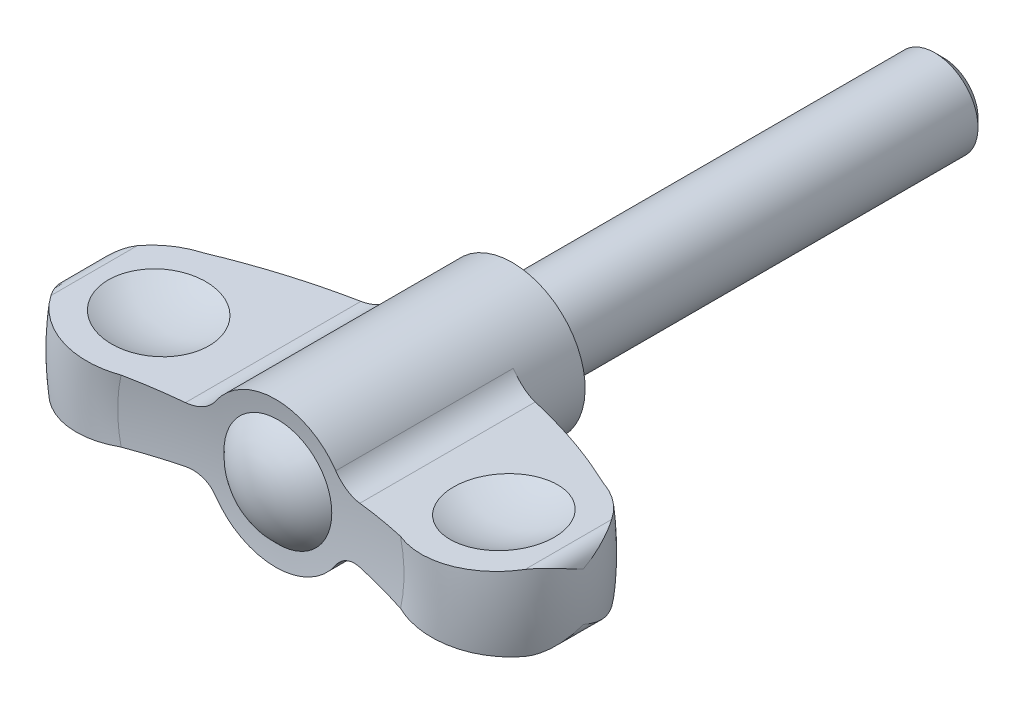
ISO-10303-21;
HEADER;
FILE_DESCRIPTION(('STEP AP214'),'2;1');
FILE_NAME('part.step','',(''),(''),'','','');
FILE_SCHEMA(('AUTOMOTIVE_DESIGN { 1 0 10303 214 1 1 1 1 }'));
ENDSEC;
DATA;
#1=APPLICATION_CONTEXT('core data for automotive mechanical design processes');
#2=APPLICATION_PROTOCOL_DEFINITION('international standard','automotive_design',2000,#1);
#3=PRODUCT_CONTEXT('',#1,'mechanical');
#4=PRODUCT('Part','Part','',(#3));
#5=PRODUCT_RELATED_PRODUCT_CATEGORY('part','',(#4));
#6=PRODUCT_DEFINITION_FORMATION('','',#4);
#7=PRODUCT_DEFINITION_CONTEXT('part definition',#1,'design');
#8=PRODUCT_DEFINITION('design','',#6,#7);
#9=PRODUCT_DEFINITION_SHAPE('','',#8);
#10=(LENGTH_UNIT() NAMED_UNIT(*) SI_UNIT(.MILLI.,.METRE.));
#11=(NAMED_UNIT(*) PLANE_ANGLE_UNIT() SI_UNIT($,.RADIAN.));
#12=(NAMED_UNIT(*) SI_UNIT($,.STERADIAN.) SOLID_ANGLE_UNIT());
#13=UNCERTAINTY_MEASURE_WITH_UNIT(LENGTH_MEASURE(1.E-05),#10,'distance_accuracy_value','');
#14=(GEOMETRIC_REPRESENTATION_CONTEXT(3) GLOBAL_UNCERTAINTY_ASSIGNED_CONTEXT((#13)) GLOBAL_UNIT_ASSIGNED_CONTEXT((#10,
#11,#12)) REPRESENTATION_CONTEXT('',''));
#15=CARTESIAN_POINT('',(0.,0.,0.));
#16=DIRECTION('',(0.,0.,1.));
#17=DIRECTION('',(1.,0.,0.));
#18=AXIS2_PLACEMENT_3D('',#15,#16,#17);
#19=CARTESIAN_POINT('',(0.,0.,60.8916836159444));
#20=DIRECTION('',(0.,0.,1.));
#21=DIRECTION('',(0.,1.,0.));
#22=AXIS2_PLACEMENT_3D('',#19,#20,#21);
#23=DEGENERATE_TOROIDAL_SURFACE('',#22,7.24809636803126,57.1330492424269,.F.);
#24=CARTESIAN_POINT('',(0.,0.,5.5));
#25=DIRECTION('',(0.,0.,1.));
#26=DIRECTION('',(0.,1.,0.));
#27=AXIS2_PLACEMENT_3D('',#24,#25,#26);
#28=CIRCLE('',#27,6.75);
#29=CARTESIAN_POINT('',(5.58468393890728,-3.79128016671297,5.5));
#30=VERTEX_POINT('',#29);
#31=CARTESIAN_POINT('',(5.58468393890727,3.79128016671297,5.5));
#32=VERTEX_POINT('',#31);
#33=EDGE_CURVE('E157',#30,#32,#28,.T.);
#34=ORIENTED_EDGE('',*,*,#33,.T.);
#35=CARTESIAN_POINT('',(5.58454817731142,3.79148016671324,5.5000000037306));
#36=CARTESIAN_POINT('',(5.6270350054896,3.72886637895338,5.49999203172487));
#37=CARTESIAN_POINT('',(5.67207292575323,3.66799067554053,5.50109190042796));
#38=CARTESIAN_POINT('',(5.76687239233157,3.55013742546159,5.50546469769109));
#39=CARTESIAN_POINT('',(5.81663303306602,3.49315913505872,5.5087372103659));
#40=CARTESIAN_POINT('',(5.92037232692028,3.3836500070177,5.51740071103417));
#41=CARTESIAN_POINT('',(5.97433893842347,3.33110730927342,5.5227858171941));
#42=CARTESIAN_POINT('',(6.08617319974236,3.23065312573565,5.53558959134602));
#43=CARTESIAN_POINT('',(6.14404090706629,3.1827417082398,5.54300828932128));
#44=CARTESIAN_POINT('',(6.32281948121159,3.04645743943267,5.56816484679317));
#45=CARTESIAN_POINT('',(6.44903201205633,2.9654018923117,5.58881397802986));
#46=CARTESIAN_POINT('',(6.71175482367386,2.82481579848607,5.63683026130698));
#47=CARTESIAN_POINT('',(6.84827321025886,2.76530241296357,5.66420274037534));
#48=CARTESIAN_POINT('',(7.13180529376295,2.66747892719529,5.72532830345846));
#49=CARTESIAN_POINT('',(7.27900617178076,2.62981214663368,5.75923917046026));
#50=CARTESIAN_POINT('',(7.57631968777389,2.57880440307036,5.83159976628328));
#51=CARTESIAN_POINT('',(7.72642802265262,2.56542990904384,5.87004316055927));
#52=CARTESIAN_POINT('',(7.91146899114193,2.56375196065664,5.91959867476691));
#53=CARTESIAN_POINT('',(7.94691227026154,2.56410633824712,5.92918950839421));
#54=CARTESIAN_POINT('',(8.01766035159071,2.56615563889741,5.94852854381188));
#55=CARTESIAN_POINT('',(8.05296528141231,2.56784856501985,5.958276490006));
#56=CARTESIAN_POINT('',(8.08821506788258,2.57020553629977,5.96810530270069));
#57=B_SPLINE_CURVE_WITH_KNOTS('',3,(#35,#36,#37,#38,#39,#40,#41,#42,#43,#44,#45,#46,#47,#48,#49,
#50,#51,#52,#53,#54,#55,#56),.UNSPECIFIED.,.F.,.F.,(4,2,2,2,2,2,2,2,2,2,4),(0.,
0.226923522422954,0.453803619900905,0.680056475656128,0.906312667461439,1.35828167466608,
1.81060994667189,2.27565813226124,2.74006391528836,2.85020967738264,2.96019142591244),.UNSPECIFIED.);
#58=CARTESIAN_POINT('',(8.08801506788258,2.57019216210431,5.96804953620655));
#59=VERTEX_POINT('',#58);
#60=EDGE_CURVE('E251',#32,#59,#57,.T.);
#61=ORIENTED_EDGE('',*,*,#60,.T.);
#62=CARTESIAN_POINT('',(18.5568278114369,3.2698755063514,10.0639861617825));
#63=CARTESIAN_POINT('',(17.7202118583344,3.21396025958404,9.63606709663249));
#64=CARTESIAN_POINT('',(16.8730027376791,3.15733701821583,9.22898268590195));
#65=CARTESIAN_POINT('',(15.1615683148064,3.04295325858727,8.45851890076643));
#66=CARTESIAN_POINT('',(14.2973907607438,2.98519593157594,8.09503297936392));
#67=CARTESIAN_POINT('',(12.5519653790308,2.86854038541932,7.41164455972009));
#68=CARTESIAN_POINT('',(11.6707170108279,2.80964213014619,7.09174344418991));
#69=CARTESIAN_POINT('',(10.3366076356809,2.72047689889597,6.64515483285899));
#70=CARTESIAN_POINT('',(9.88928279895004,2.6905799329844,6.5016730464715));
#71=CARTESIAN_POINT('',(8.99112522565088,2.63055155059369,6.22618011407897));
#72=CARTESIAN_POINT('',(8.54029244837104,2.6004201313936,6.0941691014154));
#73=CARTESIAN_POINT('',(8.08781506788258,2.57017879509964,5.96799377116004));
#74=B_SPLINE_CURVE_WITH_KNOTS('',3,(#62,#63,#64,#65,#66,#67,#68,#69,#70,#71,#72,#73),
.UNSPECIFIED.,.F.,.F.,(4,2,2,2,2,4),(0.,2.82377208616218,5.64049635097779,8.45730995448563,
9.86934742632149,11.2814013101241),.UNSPECIFIED.);
#75=CARTESIAN_POINT('',(18.5564367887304,3.26984937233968,10.0637861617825));
#76=VERTEX_POINT('',#75);
#77=EDGE_CURVE('E242',#76,#59,#74,.T.);
#78=ORIENTED_EDGE('',*,*,#77,.F.);
#79=CARTESIAN_POINT('',(0.,0.,10.0637861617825));
#80=DIRECTION('',(0.,0.,1.));
#81=DIRECTION('',(0.,1.,0.));
#82=AXIS2_PLACEMENT_3D('',#79,#80,#81);
#83=CIRCLE('',#82,18.8423263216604);
#84=CARTESIAN_POINT('',(18.5564367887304,-3.26984937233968,10.0637861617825));
#85=VERTEX_POINT('',#84);
#86=EDGE_CURVE('E402',#85,#76,#83,.T.);
#87=ORIENTED_EDGE('',*,*,#86,.F.);
#88=CARTESIAN_POINT('',(8.08781506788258,-2.57017879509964,5.96799377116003));
#89=CARTESIAN_POINT('',(8.43648524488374,-2.59348217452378,6.06521586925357));
#90=CARTESIAN_POINT('',(8.78418982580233,-2.6167210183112,6.16591362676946));
#91=CARTESIAN_POINT('',(9.47752423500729,-2.66306003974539,6.37414417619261));
#92=CARTESIAN_POINT('',(9.82315423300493,-2.68616022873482,6.48167640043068));
#93=CARTESIAN_POINT('',(10.8568675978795,-2.7552484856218,6.81439605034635));
#94=CARTESIAN_POINT('',(11.5417095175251,-2.80101991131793,7.04968835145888));
#95=CARTESIAN_POINT('',(13.5766416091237,-2.93702464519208,7.79319141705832));
#96=CARTESIAN_POINT('',(14.9128146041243,-3.02632779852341,8.34061833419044));
#97=CARTESIAN_POINT('',(16.6182429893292,-3.14031014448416,9.11672807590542));
#98=CARTESIAN_POINT('',(17.0086949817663,-3.16640601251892,9.29983650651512));
#99=CARTESIAN_POINT('',(17.785774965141,-3.21834217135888,9.67514693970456));
#100=CARTESIAN_POINT('',(18.1723980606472,-3.24418213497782,9.86735912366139));
#101=CARTESIAN_POINT('',(18.5568278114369,-3.2698755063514,10.0639861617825));
#102=B_SPLINE_CURVE_WITH_KNOTS('',3,(#88,#89,#90,#91,#92,#93,#94,#95,#96,#97,#98,#99,#100,#101),
.UNSPECIFIED.,.F.,.F.,(4,2,2,2,2,2,4),(0.,1.0881425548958,2.17619484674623,4.35250158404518,
8.68743833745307,9.98350841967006,11.2810638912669),.UNSPECIFIED.);
#103=CARTESIAN_POINT('',(8.08801506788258,-2.57019216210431,5.96804953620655));
#104=VERTEX_POINT('',#103);
#105=EDGE_CURVE('E232',#104,#85,#102,.T.);
#106=ORIENTED_EDGE('',*,*,#105,.F.);
#107=CARTESIAN_POINT('',(8.08821506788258,-2.57020553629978,5.96810530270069));
#108=CARTESIAN_POINT('',(8.00997344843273,-2.56497338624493,5.94629000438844));
#109=CARTESIAN_POINT('',(7.9314394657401,-2.5630200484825,5.92486614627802));
#110=CARTESIAN_POINT('',(7.77422277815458,-2.56573749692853,5.88295181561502));
#111=CARTESIAN_POINT('',(7.69554004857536,-2.57040950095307,5.862461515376));
#112=CARTESIAN_POINT('',(7.45993217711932,-2.59446790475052,5.80261995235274));
#113=CARTESIAN_POINT('',(7.30348188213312,-2.62389903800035,5.7649076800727));
#114=CARTESIAN_POINT('',(6.99637317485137,-2.7094115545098,5.69535012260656));
#115=CARTESIAN_POINT('',(6.84572761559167,-2.76554877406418,5.66351732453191));
#116=CARTESIAN_POINT('',(6.55526150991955,-2.90348395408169,5.60733410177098));
#117=CARTESIAN_POINT('',(6.4154250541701,-2.98524327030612,5.58297251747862));
#118=CARTESIAN_POINT('',(6.21564820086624,-3.12665619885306,5.55280138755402));
#119=CARTESIAN_POINT('',(6.14994832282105,-3.17769981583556,5.54373343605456));
#120=CARTESIAN_POINT('',(6.0231628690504,-3.28560819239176,5.52805647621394));
#121=CARTESIAN_POINT('',(5.96207731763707,-3.34247298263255,5.5214474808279));
#122=CARTESIAN_POINT('',(5.84481263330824,-3.46187538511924,5.51078652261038));
#123=CARTESIAN_POINT('',(5.78866161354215,-3.52444182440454,5.50674848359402));
#124=CARTESIAN_POINT('',(5.68213708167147,-3.65444758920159,5.50134928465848));
#125=CARTESIAN_POINT('',(5.63176510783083,-3.72188820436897,5.49998883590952));
#126=CARTESIAN_POINT('',(5.58454817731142,-3.79148016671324,5.50000000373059));
#127=B_SPLINE_CURVE_WITH_KNOTS('',3,(#107,#108,#109,#110,#111,#112,#113,#114,#115,#116,#117,
#118,#119,#120,#121,#122,#123,#124,#125,#126),.UNSPECIFIED.,.F.,.F.,(4,2,2,2,2,2,2,2,2,4),(0.,
0.244043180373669,0.488131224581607,0.976413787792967,1.46572175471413,1.95429525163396,
2.20506346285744,2.4558329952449,2.70794934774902,2.96013265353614),.UNSPECIFIED.);
#128=EDGE_CURVE('E222',#104,#30,#127,.T.);
#129=ORIENTED_EDGE('',*,*,#128,.T.);
#130=EDGE_LOOP('',(#34,#61,#78,#87,#106,#129));
#131=FACE_BOUND('',#130,.T.);
#132=ADVANCED_FACE('F14',(#131),#23,.F.);
#133=CARTESIAN_POINT('',(0.,0.,16.8));
#134=DIRECTION('',(0.,0.,1.));
#135=DIRECTION('',(0.,1.,0.));
#136=AXIS2_PLACEMENT_3D('',#133,#134,#135);
#137=TOROIDAL_SURFACE('',#136,16.3,7.2);
#138=CARTESIAN_POINT('',(-13.4430070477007,-2.92809317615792,10.0635861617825));
#139=CARTESIAN_POINT('',(-13.250045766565,-2.91519660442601,10.1357408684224));
#140=CARTESIAN_POINT('',(-13.0601324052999,-2.90250374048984,10.216071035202));
#141=CARTESIAN_POINT('',(-12.6877100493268,-2.8776128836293,10.3924240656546));
#142=CARTESIAN_POINT('',(-12.5052008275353,-2.86541487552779,10.4884464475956));
#143=CARTESIAN_POINT('',(-12.1489194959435,-2.84160280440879,10.6955091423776));
#144=CARTESIAN_POINT('',(-11.9751456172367,-2.8299886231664,10.8065463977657));
#145=CARTESIAN_POINT('',(-11.6375334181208,-2.8074243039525,11.042874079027));
#146=CARTESIAN_POINT('',(-11.47369496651,-2.79647415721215,11.1681643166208));
#147=CARTESIAN_POINT('',(-11.1570734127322,-2.77531274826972,11.4321870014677));
#148=CARTESIAN_POINT('',(-11.0042945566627,-2.76510176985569,11.5709245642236));
#149=CARTESIAN_POINT('',(-10.7109328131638,-2.74549493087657,11.8608983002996));
#150=CARTESIAN_POINT('',(-10.570354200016,-2.73609935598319,12.0121388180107));
#151=CARTESIAN_POINT('',(-10.3025713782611,-2.7182020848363,12.3259661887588));
#152=CARTESIAN_POINT('',(-10.1753613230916,-2.70969999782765,12.4885480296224));
#153=CARTESIAN_POINT('',(-9.93523518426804,-2.69365116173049,12.8239887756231));
#154=CARTESIAN_POINT('',(-9.82231883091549,-2.68610439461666,12.9968474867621));
#155=CARTESIAN_POINT('',(-9.61240942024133,-2.67207509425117,13.3504168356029));
#156=CARTESIAN_POINT('',(-9.51531257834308,-2.6655856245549,13.5310655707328));
#157=CARTESIAN_POINT('',(-9.33694719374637,-2.6536645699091,13.8999735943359));
#158=CARTESIAN_POINT('',(-9.2556730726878,-2.64823261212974,14.0882301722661));
#159=CARTESIAN_POINT('',(-9.10959731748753,-2.63846963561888,14.4711021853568));
#160=CARTESIAN_POINT('',(-9.0447989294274,-2.63413883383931,14.6657188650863));
#161=CARTESIAN_POINT('',(-8.93227844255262,-2.62661852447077,15.0598492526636));
#162=CARTESIAN_POINT('',(-8.88455601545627,-2.62342899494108,15.2593628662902));
#163=CARTESIAN_POINT('',(-8.80746852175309,-2.61827685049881,15.6574650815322));
#164=CARTESIAN_POINT('',(-8.77773054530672,-2.6162893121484,15.8559812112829));
#165=CARTESIAN_POINT('',(-8.73529826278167,-2.6134533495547,16.2548338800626));
#166=CARTESIAN_POINT('',(-8.7226036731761,-2.61260490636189,16.4551703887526));
#167=CARTESIAN_POINT('',(-8.71437606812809,-2.61205501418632,16.8561671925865));
#168=CARTESIAN_POINT('',(-8.71884052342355,-2.61235339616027,17.0568274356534));
#169=CARTESIAN_POINT('',(-8.74488386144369,-2.61409400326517,17.4570282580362));
#170=CARTESIAN_POINT('',(-8.76646264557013,-2.6155362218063,17.6565688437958));
#171=CARTESIAN_POINT('',(-8.82608238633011,-2.6195209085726,18.0500864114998));
#172=CARTESIAN_POINT('',(-8.86387061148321,-2.62204648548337,18.2441019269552));
#173=CARTESIAN_POINT('',(-8.95554073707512,-2.62817326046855,18.6283441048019));
#174=CARTESIAN_POINT('',(-9.00942811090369,-2.63177482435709,18.8185694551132));
#175=CARTESIAN_POINT('',(-9.13281555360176,-2.64002142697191,19.1937999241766));
#176=CARTESIAN_POINT('',(-9.20231107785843,-2.64466616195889,19.3788065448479));
#177=CARTESIAN_POINT('',(-9.35638258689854,-2.6549635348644,19.742479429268));
#178=CARTESIAN_POINT('',(-9.44096421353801,-2.66061654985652,19.9211432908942));
#179=CARTESIAN_POINT('',(-9.62545322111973,-2.67294687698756,20.2726485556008));
#180=CARTESIAN_POINT('',(-9.72550696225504,-2.6796339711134,20.4454127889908));
#181=CARTESIAN_POINT('',(-9.93957002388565,-2.69394088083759,20.7821124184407));
#182=CARTESIAN_POINT('',(-10.0535844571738,-2.70156103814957,20.9460445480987));
#183=CARTESIAN_POINT('',(-10.2946584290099,-2.71767322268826,21.263898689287));
#184=CARTESIAN_POINT('',(-10.4217143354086,-2.7261650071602,21.4178234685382));
#185=CARTESIAN_POINT('',(-10.688029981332,-2.74396421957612,21.7147703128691));
#186=CARTESIAN_POINT('',(-10.8272940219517,-2.75327193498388,21.8577885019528));
#187=CARTESIAN_POINT('',(-11.1201972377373,-2.77284812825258,22.1349543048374));
#188=CARTESIAN_POINT('',(-11.2740848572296,-2.78313321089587,22.2688382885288));
#189=CARTESIAN_POINT('',(-11.5924511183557,-2.80441122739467,22.5232972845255));
#190=CARTESIAN_POINT('',(-11.7569299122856,-2.81540417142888,22.6438721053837));
#191=CARTESIAN_POINT('',(-12.0953583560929,-2.83802304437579,22.8709220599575));
#192=CARTESIAN_POINT('',(-12.2693100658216,-2.84964911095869,22.9773941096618));
#193=CARTESIAN_POINT('',(-12.6253835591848,-2.87344729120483,23.175449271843));
#194=CARTESIAN_POINT('',(-12.8075027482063,-2.88561923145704,23.2670370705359));
#195=CARTESIAN_POINT('',(-13.1810420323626,-2.9105847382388,23.4357878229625));
#196=CARTESIAN_POINT('',(-13.37255033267,-2.92338419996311,23.5127547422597));
#197=CARTESIAN_POINT('',(-13.7613485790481,-2.94936953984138,23.6502587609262));
#198=CARTESIAN_POINT('',(-13.9586384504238,-2.96255541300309,23.7107960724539));
#199=CARTESIAN_POINT('',(-14.3576152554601,-2.98922103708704,23.8149976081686));
#200=CARTESIAN_POINT('',(-14.5593023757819,-3.00270080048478,23.8586611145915));
#201=CARTESIAN_POINT('',(-14.9656299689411,-3.02985771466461,23.9287762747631));
#202=CARTESIAN_POINT('',(-15.170270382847,-3.04353486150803,23.9552282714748));
#203=CARTESIAN_POINT('',(-15.5810553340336,-3.07098968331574,23.9907056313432));
#204=CARTESIAN_POINT('',(-15.7871999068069,-3.08476736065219,23.9997305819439));
#205=CARTESIAN_POINT('',(-16.1994347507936,-3.11231908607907,24.000257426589));
#206=CARTESIAN_POINT('',(-16.4055250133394,-3.1260931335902,23.9917658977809));
#207=CARTESIAN_POINT('',(-16.816299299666,-3.15354724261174,23.9572980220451));
#208=CARTESIAN_POINT('',(-17.0209829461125,-3.16722727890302,23.9313171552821));
#209=CARTESIAN_POINT('',(-17.4273317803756,-3.19438561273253,23.8620348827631));
#210=CARTESIAN_POINT('',(-17.6289980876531,-3.20786398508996,23.8187400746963));
#211=CARTESIAN_POINT('',(-18.0267250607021,-3.23444607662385,23.7154246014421));
#212=CARTESIAN_POINT('',(-18.2228121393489,-3.24755156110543,23.6555060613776));
#213=CARTESIAN_POINT('',(-18.6091495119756,-3.27337242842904,23.5192613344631));
#214=CARTESIAN_POINT('',(-18.7994018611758,-3.28608794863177,23.4429410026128));
#215=CARTESIAN_POINT('',(-19.1728922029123,-3.31105018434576,23.2743446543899));
#216=CARTESIAN_POINT('',(-19.3561252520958,-3.32329656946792,23.1820576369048));
#217=CARTESIAN_POINT('',(-19.7140940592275,-3.34722142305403,22.9822113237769));
#218=CARTESIAN_POINT('',(-19.8888301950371,-3.35889991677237,22.8746527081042));
#219=CARTESIAN_POINT('',(-20.2275235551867,-3.38153649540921,22.6457025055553));
#220=CARTESIAN_POINT('',(-20.3915386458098,-3.39249844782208,22.5243968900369));
#221=CARTESIAN_POINT('',(-20.7087215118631,-3.41369737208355,22.2682963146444));
#222=CARTESIAN_POINT('',(-20.8618896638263,-3.42393436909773,22.133501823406));
#223=CARTESIAN_POINT('',(-21.1559703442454,-3.44358925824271,21.851664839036));
#224=CARTESIAN_POINT('',(-21.296906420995,-3.45300872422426,21.704646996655));
#225=CARTESIAN_POINT('',(-21.565777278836,-3.47097871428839,21.3992346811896));
#226=CARTESIAN_POINT('',(-21.6937203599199,-3.47952979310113,21.240847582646));
#227=CARTESIAN_POINT('',(-21.8466005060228,-3.48974754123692,21.0342564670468));
#228=CARTESIAN_POINT('',(-21.8780226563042,-3.49184764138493,20.9907857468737));
#229=CARTESIAN_POINT('',(-21.9398602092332,-3.49598055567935,20.9031903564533));
#230=CARTESIAN_POINT('',(-21.9702765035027,-3.49801342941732,20.8590663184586));
#231=CARTESIAN_POINT('',(-22.0002000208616,-3.50001336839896,20.8146028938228));
#232=B_SPLINE_CURVE_WITH_KNOTS('',3,(#138,#139,#140,#141,#142,#143,#144,#145,#146,#147,#148,
#149,#150,#151,#152,#153,#154,#155,#156,#157,#158,#159,#160,#161,#162,#163,#164,#165,#166,#167,
#168,#169,#170,#171,#172,#173,#174,#175,#176,#177,#178,#179,#180,#181,#182,#183,#184,#185,#186,
#187,#188,#189,#190,#191,#192,#193,#194,#195,#196,#197,#198,#199,#200,#201,#202,#203,#204,#205,
#206,#207,#208,#209,#210,#211,#212,#213,#214,#215,#216,#217,#218,#219,#220,#221,#222,#223,#224,
#225,#226,#227,#228,#229,#230,#231),.UNSPECIFIED.,.F.,.F.,(4,2,2,2,2,2,2,2,2,2,2,2,2,2,2,2,2,2,
2,2,2,2,2,2,2,2,2,2,2,2,2,2,2,2,2,2,2,2,2,2,2,2,2,2,2,2,4),(0.,0.619053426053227,
1.23808785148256,1.85699641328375,2.47589680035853,3.09503355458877,3.71438635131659,
4.33346714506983,4.95253625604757,5.56736438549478,6.18197536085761,6.79670733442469,
7.41142748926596,8.01292036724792,8.61440323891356,9.21579745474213,9.81718820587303,
10.4095249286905,11.0020632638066,11.5944292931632,12.1870173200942,12.7855991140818,
13.3844007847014,13.9830361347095,14.5818832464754,15.1938756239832,15.8058768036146,
16.4180115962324,17.029953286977,17.6495959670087,18.2692306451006,18.8888916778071,
19.5085403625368,20.1282037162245,20.7476344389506,21.3672253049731,21.9865802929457,
22.6022115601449,23.217623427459,23.8334610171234,24.4492711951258,25.0614231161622,
25.6735537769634,26.2844785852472,26.8950106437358,27.0560402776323,27.216923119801),.UNSPECIFIED.);
#233=CARTESIAN_POINT('',(-12.9627653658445,-2.89599621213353,23.3370956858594));
#234=VERTEX_POINT('',#233);
#235=CARTESIAN_POINT('',(-22.0000000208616,-3.5,20.8149000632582));
#236=VERTEX_POINT('',#235);
#237=EDGE_CURVE('E276',#234,#236,#232,.T.);
#238=ORIENTED_EDGE('',*,*,#237,.F.);
#239=CARTESIAN_POINT('',(0.,0.,23.3370956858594));
#240=DIRECTION('',(0.,0.,1.));
#241=DIRECTION('',(0.,1.,0.));
#242=AXIS2_PLACEMENT_3D('',#239,#240,#241);
#243=CIRCLE('',#242,13.2823220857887);
#244=CARTESIAN_POINT('',(-12.9627653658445,2.89599621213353,23.3370956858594));
#245=VERTEX_POINT('',#244);
#246=EDGE_CURVE('E210',#245,#234,#243,.T.);
#247=ORIENTED_EDGE('',*,*,#246,.F.);
#248=CARTESIAN_POINT('',(-22.0002,3.50001336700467,20.8146029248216));
#249=CARTESIAN_POINT('',(-21.8869659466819,3.49244536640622,20.9829001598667));
#250=CARTESIAN_POINT('',(-21.7665908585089,3.48440009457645,21.1463645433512));
#251=CARTESIAN_POINT('',(-21.5125154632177,3.46741895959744,21.4625195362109));
#252=CARTESIAN_POINT('',(-21.378816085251,3.45848315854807,21.6152108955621));
#253=CARTESIAN_POINT('',(-21.0991608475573,3.43979239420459,21.9086013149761));
#254=CARTESIAN_POINT('',(-20.9532163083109,3.43003818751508,22.0493112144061));
#255=CARTESIAN_POINT('',(-20.6500231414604,3.4097742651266,22.3179109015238));
#256=CARTESIAN_POINT('',(-20.4927745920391,3.399264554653,22.445800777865));
#257=CARTESIAN_POINT('',(-20.1680719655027,3.377563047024,22.6878898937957));
#258=CARTESIAN_POINT('',(-20.0006161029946,3.36637113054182,22.8020867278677));
#259=CARTESIAN_POINT('',(-19.6566594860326,3.34338278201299,23.0160136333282));
#260=CARTESIAN_POINT('',(-19.4801554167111,3.33158612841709,23.1157383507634));
#261=CARTESIAN_POINT('',(-19.1195107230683,3.3074824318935,23.299940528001));
#262=CARTESIAN_POINT('',(-18.9353740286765,3.29517565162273,23.3844257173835));
#263=CARTESIAN_POINT('',(-18.5606181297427,3.27012883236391,23.5376689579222));
#264=CARTESIAN_POINT('',(-18.369996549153,3.25738863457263,23.6064211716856));
#265=CARTESIAN_POINT('',(-17.9830362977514,3.23152613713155,23.7279050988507));
#266=CARTESIAN_POINT('',(-17.7866806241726,3.21840270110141,23.780582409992));
#267=CARTESIAN_POINT('',(-17.3901835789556,3.19190281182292,23.8692781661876));
#268=CARTESIAN_POINT('',(-17.1900408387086,3.17852626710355,23.9052904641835));
#269=CARTESIAN_POINT('',(-16.7874574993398,3.15161960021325,23.9604036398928));
#270=CARTESIAN_POINT('',(-16.5850169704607,3.13808948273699,23.9795050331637));
#271=CARTESIAN_POINT('',(-16.1792478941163,3.11096989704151,24.0006952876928));
#272=CARTESIAN_POINT('',(-15.9759193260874,3.09738042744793,24.0027837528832));
#273=CARTESIAN_POINT('',(-15.5684666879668,3.07014832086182,23.9899203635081));
#274=CARTESIAN_POINT('',(-15.364346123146,3.05650591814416,23.9748568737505));
#275=CARTESIAN_POINT('',(-14.9580777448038,3.02935296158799,23.9276425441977));
#276=CARTESIAN_POINT('',(-14.755929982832,3.01584241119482,23.8954912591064));
#277=CARTESIAN_POINT('',(-14.3550670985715,2.98905073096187,23.814360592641));
#278=CARTESIAN_POINT('',(-14.1563513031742,2.97576955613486,23.7653845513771));
#279=CARTESIAN_POINT('',(-13.7636331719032,2.94952223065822,23.6509482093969));
#280=CARTESIAN_POINT('',(-13.5696323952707,2.9365561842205,23.5854825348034));
#281=CARTESIAN_POINT('',(-13.1865164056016,2.91095061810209,23.4380671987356));
#282=CARTESIAN_POINT('',(-12.9974412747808,2.89831377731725,23.356012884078));
#283=CARTESIAN_POINT('',(-12.6268363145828,2.87354438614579,23.1762764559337));
#284=CARTESIAN_POINT('',(-12.4453065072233,2.86141183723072,23.078594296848));
#285=CARTESIAN_POINT('',(-12.0910342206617,2.83773404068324,22.8682633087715));
#286=CARTESIAN_POINT('',(-11.9182938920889,2.8261889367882,22.7556108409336));
#287=CARTESIAN_POINT('',(-11.5829402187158,2.80377556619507,22.516182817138));
#288=CARTESIAN_POINT('',(-11.4203233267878,2.79290706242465,22.3894122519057));
#289=CARTESIAN_POINT('',(-11.1059013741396,2.77189266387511,22.1222291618));
#290=CARTESIAN_POINT('',(-10.9541266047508,2.76174879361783,21.9817808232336));
#291=CARTESIAN_POINT('',(-10.6630509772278,2.74229474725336,21.6885550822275));
#292=CARTESIAN_POINT('',(-10.5237454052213,2.73298425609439,21.5357823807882));
#293=CARTESIAN_POINT('',(-10.2585504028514,2.71525994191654,21.2188580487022));
#294=CARTESIAN_POINT('',(-10.1326659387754,2.7068464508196,21.0547022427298));
#295=CARTESIAN_POINT('',(-9.89540453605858,2.69098907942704,20.7162706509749));
#296=CARTESIAN_POINT('',(-9.78402188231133,2.68354481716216,20.5419988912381));
#297=CARTESIAN_POINT('',(-9.57753567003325,2.66974430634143,20.1860989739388));
#298=CARTESIAN_POINT('',(-9.48229586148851,2.66337895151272,20.0045502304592));
#299=CARTESIAN_POINT('',(-9.30772151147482,2.65171127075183,19.6340070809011));
#300=CARTESIAN_POINT('',(-9.22838099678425,2.64640854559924,19.445015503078));
#301=CARTESIAN_POINT('',(-9.0862443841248,2.6369088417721,19.0608700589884));
#302=CARTESIAN_POINT('',(-9.02344908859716,2.63271191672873,18.8657158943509));
#303=CARTESIAN_POINT('',(-8.91497467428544,2.62546202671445,18.4706862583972));
#304=CARTESIAN_POINT('',(-8.86929523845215,2.62240904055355,18.2708108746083));
#305=CARTESIAN_POINT('',(-8.79627719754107,2.61752887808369,17.8722020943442));
#306=CARTESIAN_POINT('',(-8.76856256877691,2.61567657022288,17.6735378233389));
#307=CARTESIAN_POINT('',(-8.73017446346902,2.61311090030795,17.2745631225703));
#308=CARTESIAN_POINT('',(-8.71950071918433,2.61239752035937,17.0742527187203));
#309=CARTESIAN_POINT('',(-8.71529310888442,2.61211630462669,16.6734663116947));
#310=CARTESIAN_POINT('',(-8.72175798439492,2.61254838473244,16.4729903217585));
#311=CARTESIAN_POINT('',(-8.75176494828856,2.61455390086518,16.0733272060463));
#312=CARTESIAN_POINT('',(-8.77530694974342,2.61612733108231,15.8741400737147));
#313=CARTESIAN_POINT('',(-8.83878915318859,2.62037016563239,15.481363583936));
#314=CARTESIAN_POINT('',(-8.87848770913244,2.62302341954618,15.2877349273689));
#315=CARTESIAN_POINT('',(-8.97393104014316,2.62940237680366,14.9044232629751));
#316=CARTESIAN_POINT('',(-9.029681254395,2.6331284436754,14.7147416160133));
#317=CARTESIAN_POINT('',(-9.15673580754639,2.64162013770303,14.3407362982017));
#318=CARTESIAN_POINT('',(-9.2280365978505,2.64638552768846,14.1564114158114));
#319=CARTESIAN_POINT('',(-9.38562068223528,2.65691766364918,13.7943056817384));
#320=CARTESIAN_POINT('',(-9.47190458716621,2.66268445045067,13.6165250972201));
#321=CARTESIAN_POINT('',(-9.65980249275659,2.67524261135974,13.2667770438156));
#322=CARTESIAN_POINT('',(-9.76157423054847,2.68204452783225,13.094894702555));
#323=CARTESIAN_POINT('',(-9.97895442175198,2.69657313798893,12.7601587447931));
#324=CARTESIAN_POINT('',(-10.094562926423,2.70429983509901,12.5973051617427));
#325=CARTESIAN_POINT('',(-10.3388280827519,2.72062530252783,12.28159984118));
#326=CARTESIAN_POINT('',(-10.4674919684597,2.72922455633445,12.1287537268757));
#327=CARTESIAN_POINT('',(-10.7368892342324,2.74722972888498,11.8341521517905));
#328=CARTESIAN_POINT('',(-10.8776225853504,2.75663564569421,11.6923966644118));
#329=CARTESIAN_POINT('',(-11.1735584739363,2.77641452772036,11.4177499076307));
#330=CARTESIAN_POINT('',(-11.3290201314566,2.78680481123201,11.2851390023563));
#331=CARTESIAN_POINT('',(-11.6503816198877,2.80828301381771,11.0334204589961));
#332=CARTESIAN_POINT('',(-11.8162777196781,2.81937068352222,10.914308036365));
#333=CARTESIAN_POINT('',(-12.1571151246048,2.8421505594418,10.690516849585));
#334=CARTESIAN_POINT('',(-12.3320419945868,2.85384180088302,10.5858159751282));
#335=CARTESIAN_POINT('',(-12.6898958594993,2.87775897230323,10.3913862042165));
#336=CARTESIAN_POINT('',(-12.8728180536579,2.88998458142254,10.3016484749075));
#337=CARTESIAN_POINT('',(-13.1223586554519,2.90666263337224,10.1918600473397));
#338=CARTESIAN_POINT('',(-13.1860214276,2.9109175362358,10.1649193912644));
#339=CARTESIAN_POINT('',(-13.3140099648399,2.91947165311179,10.1128788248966));
#340=CARTESIAN_POINT('',(-13.3783349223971,2.92377081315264,10.0877769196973));
#341=CARTESIAN_POINT('',(-13.4430070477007,2.92809317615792,10.0635861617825));
#342=B_SPLINE_CURVE_WITH_KNOTS('',3,(#248,#249,#250,#251,#252,#253,#254,#255,#256,#257,#258,
#259,#260,#261,#262,#263,#264,#265,#266,#267,#268,#269,#270,#271,#272,#273,#274,#275,#276,#277,
#278,#279,#280,#281,#282,#283,#284,#285,#286,#287,#288,#289,#290,#291,#292,#293,#294,#295,#296,
#297,#298,#299,#300,#301,#302,#303,#304,#305,#306,#307,#308,#309,#310,#311,#312,#313,#314,#315,
#316,#317,#318,#319,#320,#321,#322,#323,#324,#325,#326,#327,#328,#329,#330,#331,#332,#333,#334,
#335,#336,#337,#338,#339,#340,#341),.UNSPECIFIED.,.F.,.F.,(4,2,2,2,2,2,2,2,2,2,2,2,2,2,2,2,2,2,
2,2,2,2,2,2,2,2,2,2,2,2,2,2,2,2,2,2,2,2,2,2,2,2,2,2,2,2,4),(0.,0.608767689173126,
1.21749295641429,1.82566153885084,2.43382591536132,3.04209697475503,3.65059249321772,
4.25877850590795,4.86718980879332,5.47763788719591,6.08831095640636,6.698965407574,
7.30963407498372,7.92430017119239,8.53898228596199,9.15354244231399,9.76830314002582,
10.387070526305,11.0058397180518,11.6247595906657,12.2434613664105,12.8638290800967,
13.4839612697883,14.1043221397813,14.7244377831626,15.3390262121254,15.9533833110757,
16.5677702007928,17.1821457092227,17.7832066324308,18.3842581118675,18.9852654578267,
19.5862697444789,20.1785973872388,20.7711259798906,21.3635195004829,21.9559371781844,
22.5548514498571,23.1537679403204,23.7530181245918,24.3522668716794,24.9653566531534,
25.5782284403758,26.1901492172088,26.8017074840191,27.0094652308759,27.2169941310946),.UNSPECIFIED.);
#343=CARTESIAN_POINT('',(-22.,3.5,20.8149000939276));
#344=VERTEX_POINT('',#343);
#345=EDGE_CURVE('E298',#344,#245,#342,.T.);
#346=ORIENTED_EDGE('',*,*,#345,.F.);
#347=CARTESIAN_POINT('',(-23.3936651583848,2.23303167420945,16.8));
#348=CARTESIAN_POINT('',(-23.3934426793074,2.23536251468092,16.8051493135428));
#349=CARTESIAN_POINT('',(-23.3932143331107,2.23769289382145,16.8102988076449));
#350=CARTESIAN_POINT('',(-23.3743145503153,2.42570445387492,17.2258528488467));
#351=CARTESIAN_POINT('',(-23.3183956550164,2.60830531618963,17.6373544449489));
#352=CARTESIAN_POINT('',(-23.1798743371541,2.85965877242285,18.2505518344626));
#353=CARTESIAN_POINT('',(-23.1245479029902,2.939723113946,18.4543861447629));
#354=CARTESIAN_POINT('',(-22.9956909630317,3.08909813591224,18.8603432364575));
#355=CARTESIAN_POINT('',(-22.9221687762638,3.1584137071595,19.0624667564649));
#356=CARTESIAN_POINT('',(-22.7850793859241,3.26116367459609,19.3959296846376));
#357=CARTESIAN_POINT('',(-22.7265638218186,3.29880232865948,19.5280746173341));
#358=CARTESIAN_POINT('',(-22.6018254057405,3.36602668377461,19.7906656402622));
#359=CARTESIAN_POINT('',(-22.5356088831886,3.39561893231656,19.9211130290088));
#360=CARTESIAN_POINT('',(-22.395316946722,3.44509635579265,20.180513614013));
#361=CARTESIAN_POINT('',(-22.3212053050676,3.46493421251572,20.3094566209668));
#362=CARTESIAN_POINT('',(-22.2046559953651,3.48552373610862,20.500765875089));
#363=CARTESIAN_POINT('',(-22.1648550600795,3.49085996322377,20.5642643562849));
#364=CARTESIAN_POINT('',(-22.0835651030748,3.49809816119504,20.6904076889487));
#365=CARTESIAN_POINT('',(-22.0420753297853,3.49999858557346,20.7530521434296));
#366=CARTESIAN_POINT('',(-21.9998,3.49999998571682,20.8151941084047));
#367=B_SPLINE_CURVE_WITH_KNOTS('',3,(#347,#348,#349,#350,#351,#352,#353,#354,#355,#356,#357,
#358,#359,#360,#361,#362,#363,#364,#365,#366),.UNSPECIFIED.,.F.,.F.,(4,2,2,2,2,2,2,2,2,4),(0.,
0.016970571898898,1.36944581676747,2.04642868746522,2.72310261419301,3.17077232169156,
3.61807665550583,4.06752995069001,4.29283181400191,4.51823506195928),.UNSPECIFIED.);
#368=CARTESIAN_POINT('',(-23.3936651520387,2.23303174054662,16.8));
#369=VERTEX_POINT('',#368);
#370=EDGE_CURVE('E360',#369,#344,#367,.T.);
#371=ORIENTED_EDGE('',*,*,#370,.F.);
#372=CARTESIAN_POINT('',(-21.9998,3.49999998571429,12.7848058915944));
#373=CARTESIAN_POINT('',(-22.0666741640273,3.49996244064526,12.8830879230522));
#374=CARTESIAN_POINT('',(-22.1315514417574,3.4952325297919,12.9826100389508));
#375=CARTESIAN_POINT('',(-22.2568815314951,3.47769367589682,13.1835115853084));
#376=CARTESIAN_POINT('',(-22.3173409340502,3.46489705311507,13.2848879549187));
#377=CARTESIAN_POINT('',(-22.4333648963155,3.43259083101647,13.4887461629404));
#378=CARTESIAN_POINT('',(-22.4889490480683,3.41310980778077,13.5912215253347));
#379=CARTESIAN_POINT('',(-22.5953729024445,3.3684102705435,13.7974289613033));
#380=CARTESIAN_POINT('',(-22.6462099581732,3.34318858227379,13.9011616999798));
#381=CARTESIAN_POINT('',(-22.774089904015,3.2701146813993,14.1765334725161));
#382=CARTESIAN_POINT('',(-22.8470051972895,3.21812877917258,14.3490158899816));
#383=CARTESIAN_POINT('',(-22.9794561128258,3.10414337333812,14.695745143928));
#384=CARTESIAN_POINT('',(-23.0389856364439,3.04213932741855,14.8699927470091));
#385=CARTESIAN_POINT('',(-23.1975205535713,2.84462859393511,15.3951794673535));
#386=CARTESIAN_POINT('',(-23.2763283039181,2.6977147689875,15.7482515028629));
#387=CARTESIAN_POINT('',(-23.3443046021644,2.49442989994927,16.2153989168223));
#388=CARTESIAN_POINT('',(-23.3580236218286,2.44419371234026,16.3292368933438));
#389=CARTESIAN_POINT('',(-23.3797700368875,2.34273549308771,16.5569077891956));
#390=CARTESIAN_POINT('',(-23.3878040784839,2.29151468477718,16.6707405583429));
#391=CARTESIAN_POINT('',(-23.3932143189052,2.23769296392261,16.7897010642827));
#392=CARTESIAN_POINT('',(-23.3934426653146,2.23536258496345,16.7948505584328));
#393=CARTESIAN_POINT('',(-23.3936651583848,2.23303167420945,16.8));
#394=B_SPLINE_CURVE_WITH_KNOTS('',3,(#372,#373,#374,#375,#376,#377,#378,#379,#380,#381,#382,
#383,#384,#385,#386,#387,#388,#389,#390,#391,#392,#393),.UNSPECIFIED.,.F.,.F.,(4,2,2,2,2,2,2,2,
2,2,4),(0.,0.356372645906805,0.712202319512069,1.06652937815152,1.42105283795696,
2.00316709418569,2.58554603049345,3.75135617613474,4.12686584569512,4.5019357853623,
4.51890635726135),.UNSPECIFIED.);
#395=CARTESIAN_POINT('',(-22.,3.5,12.7850999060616));
#396=VERTEX_POINT('',#395);
#397=EDGE_CURVE('E354',#396,#369,#394,.T.);
#398=ORIENTED_EDGE('',*,*,#397,.F.);
#399=CARTESIAN_POINT('',(-18.5559048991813,3.26981382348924,10.0635861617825));
#400=CARTESIAN_POINT('',(-18.7481532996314,3.28266274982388,10.1358408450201));
#401=CARTESIAN_POINT('',(-18.9373210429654,3.29530578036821,10.2163336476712));
#402=CARTESIAN_POINT('',(-19.308161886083,3.32009093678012,10.3931469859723));
#403=CARTESIAN_POINT('',(-19.4898343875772,3.332233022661,10.4894687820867));
#404=CARTESIAN_POINT('',(-19.8398224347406,3.35562448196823,10.6946430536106));
#405=CARTESIAN_POINT('',(-20.0083599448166,3.36688869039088,10.8031155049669));
#406=CARTESIAN_POINT('',(-20.3358278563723,3.38877501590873,11.0337190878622));
#407=CARTESIAN_POINT('',(-20.4947599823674,3.39939724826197,11.1558477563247));
#408=CARTESIAN_POINT('',(-20.7764213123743,3.41822208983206,11.3915935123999));
#409=CARTESIAN_POINT('',(-20.9007819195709,3.42653373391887,11.5032605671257));
#410=CARTESIAN_POINT('',(-21.141456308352,3.44261921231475,11.7349898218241));
#411=CARTESIAN_POINT('',(-21.2577703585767,3.45039306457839,11.8550517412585));
#412=CARTESIAN_POINT('',(-21.4842055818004,3.46552686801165,12.105686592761));
#413=CARTESIAN_POINT('',(-21.5941379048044,3.47287419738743,12.2364309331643));
#414=CARTESIAN_POINT('',(-21.8044661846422,3.48693149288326,12.5054420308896));
#415=CARTESIAN_POINT('',(-21.9048606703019,3.49364136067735,12.6437099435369));
#416=CARTESIAN_POINT('',(-22.0002,3.50001336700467,12.7853970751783));
#417=B_SPLINE_CURVE_WITH_KNOTS('',3,(#399,#400,#401,#402,#403,#404,#405,#406,#407,#408,#409,
#410,#411,#412,#413,#414,#415,#416),.UNSPECIFIED.,.F.,.F.,(4,2,2,2,2,2,2,2,4),(0.,
0.617158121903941,1.23436541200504,1.83590974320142,2.43734575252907,2.93898887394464,
3.44061523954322,3.95311321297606,4.46569010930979),.UNSPECIFIED.);
#418=CARTESIAN_POINT('',(-18.5564367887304,3.26984937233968,10.0637861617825));
#419=VERTEX_POINT('',#418);
#420=EDGE_CURVE('E277',#419,#396,#417,.T.);
#421=ORIENTED_EDGE('',*,*,#420,.F.);
#422=CARTESIAN_POINT('',(-18.5564367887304,-3.26984937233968,10.0637861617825));
#423=VERTEX_POINT('',#422);
#424=EDGE_CURVE('E399',#419,#423,#83,.T.);
#425=ORIENTED_EDGE('',*,*,#424,.T.);
#426=CARTESIAN_POINT('',(-22.0002000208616,-3.50001336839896,12.7853971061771));
#427=CARTESIAN_POINT('',(-21.8855721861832,-3.49235221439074,12.6150255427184));
#428=CARTESIAN_POINT('',(-21.7636225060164,-3.48420170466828,12.4496052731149));
#429=CARTESIAN_POINT('',(-21.5060663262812,-3.46698793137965,12.1298039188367));
#430=CARTESIAN_POINT('',(-21.3704594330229,-3.45792464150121,11.9754231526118));
#431=CARTESIAN_POINT('',(-21.0901761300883,-3.43919190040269,11.6826018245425));
#432=CARTESIAN_POINT('',(-20.9458162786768,-3.42954360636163,11.5438566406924));
#433=CARTESIAN_POINT('',(-20.6460984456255,-3.4095119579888,11.2788991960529));
#434=CARTESIAN_POINT('',(-20.4907422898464,-3.39912872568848,11.1526848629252));
#435=CARTESIAN_POINT('',(-20.1963110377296,-3.3794504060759,10.9331636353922));
#436=CARTESIAN_POINT('',(-20.058720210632,-3.37025451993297,10.8378487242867));
#437=CARTESIAN_POINT('',(-19.7772660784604,-3.35144352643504,10.6570247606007));
#438=CARTESIAN_POINT('',(-19.6334029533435,-3.34182843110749,10.571515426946));
#439=CARTESIAN_POINT('',(-19.3369202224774,-3.32201300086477,10.4089623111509));
#440=CARTESIAN_POINT('',(-19.1841783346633,-3.31180449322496,10.3321425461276));
#441=CARTESIAN_POINT('',(-18.8736362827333,-3.29104940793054,10.1895126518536));
#442=CARTESIAN_POINT('',(-18.7158354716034,-3.28050278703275,10.123703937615));
#443=CARTESIAN_POINT('',(-18.5559048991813,-3.26981382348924,10.0635861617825));
#444=B_SPLINE_CURVE_WITH_KNOTS('',3,(#426,#427,#428,#429,#430,#431,#432,#433,#434,#435,#436,
#437,#438,#439,#440,#441,#442,#443),.UNSPECIFIED.,.F.,.F.,(4,2,2,2,2,2,2,2,4),(0.,
0.616269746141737,1.23255726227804,1.83324114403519,2.43382551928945,2.93633271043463,
3.43882549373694,3.95222439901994,4.46568922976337),.UNSPECIFIED.);
#445=CARTESIAN_POINT('',(-22.0000000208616,-3.5,12.7850999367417));
#446=VERTEX_POINT('',#445);
#447=EDGE_CURVE('E530',#446,#423,#444,.T.);
#448=ORIENTED_EDGE('',*,*,#447,.F.);
#449=CARTESIAN_POINT('',(-23.3936651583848,-2.23303167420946,16.8));
#450=CARTESIAN_POINT('',(-23.3934426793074,-2.23536251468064,16.794850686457));
#451=CARTESIAN_POINT('',(-23.3932143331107,-2.23769289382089,16.7897011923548));
#452=CARTESIAN_POINT('',(-23.3743145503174,-2.42570445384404,16.374147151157));
#453=CARTESIAN_POINT('',(-23.3183956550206,-2.60830531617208,15.9626455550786));
#454=CARTESIAN_POINT('',(-23.1798743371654,-2.85965877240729,15.349448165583));
#455=CARTESIAN_POINT('',(-23.1245479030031,-2.93972311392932,15.1456138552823));
#456=CARTESIAN_POINT('',(-22.9956909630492,-3.0890981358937,14.739656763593));
#457=CARTESIAN_POINT('',(-22.922168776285,-3.15841370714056,14.5375332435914));
#458=CARTESIAN_POINT('',(-22.7850793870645,-3.26116367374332,14.2040703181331));
#459=CARTESIAN_POINT('',(-22.7265638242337,-3.29880232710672,14.0719253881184));
#460=CARTESIAN_POINT('',(-22.6018254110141,-3.36602668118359,13.8093343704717));
#461=CARTESIAN_POINT('',(-22.5356088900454,-3.39561892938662,13.6788869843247));
#462=CARTESIAN_POINT('',(-22.3953169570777,-3.44509635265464,13.4194864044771));
#463=CARTESIAN_POINT('',(-22.3212053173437,-3.46493420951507,13.2905434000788));
#464=CARTESIAN_POINT('',(-22.2046560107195,-3.48552373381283,13.0992341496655));
#465=CARTESIAN_POINT('',(-22.1648550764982,-3.49085996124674,13.035735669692));
#466=CARTESIAN_POINT('',(-22.083565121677,-3.49809816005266,12.9095923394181));
#467=CARTESIAN_POINT('',(-22.0420753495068,-3.49999858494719,12.8469478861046));
#468=CARTESIAN_POINT('',(-21.9998000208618,-3.4999999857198,12.784805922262));
#469=B_SPLINE_CURVE_WITH_KNOTS('',3,(#449,#450,#451,#452,#453,#454,#455,#456,#457,#458,#459,
#460,#461,#462,#463,#464,#465,#466,#467,#468),.UNSPECIFIED.,.F.,.F.,(4,2,2,2,2,2,2,2,2,4),(0.,
0.0169705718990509,1.36944581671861,2.0464286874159,2.72310261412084,3.17077231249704,
3.61807663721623,4.06752992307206,4.29283178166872,4.51823502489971),.UNSPECIFIED.);
#470=CARTESIAN_POINT('',(-23.393665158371,-2.23303167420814,16.8));
#471=VERTEX_POINT('',#470);
#472=EDGE_CURVE('E372',#471,#446,#469,.T.);
#473=ORIENTED_EDGE('',*,*,#472,.F.);
#474=CARTESIAN_POINT('',(-21.9998000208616,-3.49999998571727,20.8151940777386));
#475=CARTESIAN_POINT('',(-22.0666741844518,-3.49996243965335,20.7169120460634));
#476=CARTESIAN_POINT('',(-22.1315514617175,-3.49523252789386,20.617389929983));
#477=CARTESIAN_POINT('',(-22.2568815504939,-3.47769367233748,20.4164883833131));
#478=CARTESIAN_POINT('',(-22.3173409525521,-3.46489704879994,20.315112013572));
#479=CARTESIAN_POINT('',(-22.4333649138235,-3.43259082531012,20.111253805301));
#480=CARTESIAN_POINT('',(-22.488949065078,-3.41310980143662,20.0087784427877));
#481=CARTESIAN_POINT('',(-22.5953729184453,-3.36841026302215,19.802571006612));
#482=CARTESIAN_POINT('',(-22.6462099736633,-3.34318857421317,19.6988382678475));
#483=CARTESIAN_POINT('',(-22.7740899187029,-3.27011467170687,19.4234664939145));
#484=CARTESIAN_POINT('',(-22.8470052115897,-3.21812876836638,19.2509840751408));
#485=CARTESIAN_POINT('',(-22.9794561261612,-3.10414336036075,18.9042548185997));
#486=CARTESIAN_POINT('',(-23.0389856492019,-3.04213931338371,18.7300072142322));
#487=CARTESIAN_POINT('',(-23.1975205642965,-2.84462857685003,18.2048204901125));
#488=CARTESIAN_POINT('',(-23.2763283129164,-2.69771475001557,17.8517484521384));
#489=CARTESIAN_POINT('',(-23.3443046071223,-2.49442988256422,17.3846010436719));
#490=CARTESIAN_POINT('',(-23.3580236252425,-2.44419369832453,17.2707630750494));
#491=CARTESIAN_POINT('',(-23.379770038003,-2.34273548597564,17.0430921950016));
#492=CARTESIAN_POINT('',(-23.3878040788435,-2.29151468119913,16.9292594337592));
#493=CARTESIAN_POINT('',(-23.3932143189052,-2.23769296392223,16.8102989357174));
#494=CARTESIAN_POINT('',(-23.3934426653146,-2.23536258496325,16.8051494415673));
#495=CARTESIAN_POINT('',(-23.3936651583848,-2.23303167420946,16.8));
#496=B_SPLINE_CURVE_WITH_KNOTS('',3,(#474,#475,#476,#477,#478,#479,#480,#481,#482,#483,#484,
#485,#486,#487,#488,#489,#490,#491,#492,#493,#494,#495),.UNSPECIFIED.,.F.,.F.,(4,2,2,2,2,2,2,2,
2,2,4),(0.,0.356372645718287,0.712202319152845,1.0665293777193,1.42105283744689,
2.00316709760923,2.58554603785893,3.75135619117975,4.12686583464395,4.50193574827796,
4.51890632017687),.UNSPECIFIED.);
#497=EDGE_CURVE('E366',#236,#471,#496,.T.);
#498=ORIENTED_EDGE('',*,*,#497,.F.);
#499=EDGE_LOOP('',(#238,#247,#346,#371,#398,#421,#425,#448,#473,#498));
#500=FACE_BOUND('',#499,.T.);
#501=ADVANCED_FACE('F391',(#500),#137,.T.);
#502=CARTESIAN_POINT('',(0.,0.,0.));
#503=DIRECTION('',(0.,0.,1.));
#504=DIRECTION('',(0.,1.,0.));
#505=AXIS2_PLACEMENT_3D('',#502,#503,#504);
#506=PLANE('',#505);
#507=CARTESIAN_POINT('',(0.,0.,0.));
#508=DIRECTION('',(0.,0.,1.));
#509=DIRECTION('',(0.,1.,0.));
#510=AXIS2_PLACEMENT_3D('',#507,#508,#509);
#511=CIRCLE('',#510,4.);
#512=CARTESIAN_POINT('',(0.,4.,0.));
#513=VERTEX_POINT('',#512);
#514=EDGE_CURVE('E552',#513,#513,#511,.F.);
#515=ORIENTED_EDGE('',*,*,#514,.F.);
#516=EDGE_LOOP('',(#515));
#517=FACE_BOUND('',#516,.T.);
#518=CARTESIAN_POINT('',(0.,0.,0.));
#519=DIRECTION('',(0.,0.,1.));
#520=DIRECTION('',(0.,1.,0.));
#521=AXIS2_PLACEMENT_3D('',#518,#519,#520);
#522=CIRCLE('',#521,6.75);
#523=CARTESIAN_POINT('',(0.,6.75,0.));
#524=VERTEX_POINT('',#523);
#525=EDGE_CURVE('E146',#524,#524,#522,.T.);
#526=ORIENTED_EDGE('',*,*,#525,.F.);
#527=EDGE_LOOP('',(#526));
#528=FACE_BOUND('',#527,.T.);
#529=ADVANCED_FACE('F395',(#517,#528),#506,.F.);
#530=CARTESIAN_POINT('',(0.,0.,21.5));
#531=DIRECTION('',(0.,0.,1.));
#532=DIRECTION('',(0.,1.,0.));
#533=AXIS2_PLACEMENT_3D('',#530,#531,#532);
#534=CYLINDRICAL_SURFACE('',#533,6.75);
#535=CARTESIAN_POINT('',(-5.58468393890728,3.79128016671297,5.5));
#536=VERTEX_POINT('',#535);
#537=CARTESIAN_POINT('',(-5.58468393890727,-3.79128016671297,5.5));
#538=VERTEX_POINT('',#537);
#539=EDGE_CURVE('E398',#536,#538,#28,.T.);
#540=ORIENTED_EDGE('',*,*,#539,.F.);
#541=DIRECTION('',(0.,0.,-1.));
#542=VECTOR('',#541,1.);
#543=CARTESIAN_POINT('',(-5.58468393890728,3.79128016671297,47.));
#544=LINE('',#543,#542);
#545=CARTESIAN_POINT('',(-5.58468393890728,3.79128016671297,21.9677808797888));
#546=VERTEX_POINT('',#545);
#547=EDGE_CURVE('E447',#546,#536,#544,.T.);
#548=ORIENTED_EDGE('',*,*,#547,.F.);
#549=CARTESIAN_POINT('',(0.,0.,21.9677808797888));
#550=DIRECTION('',(0.,0.,1.));
#551=DIRECTION('',(0.,1.,0.));
#552=AXIS2_PLACEMENT_3D('',#549,#550,#551);
#553=CIRCLE('',#552,6.75);
#554=CARTESIAN_POINT('',(5.58468393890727,3.79128016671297,21.9677808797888));
#555=VERTEX_POINT('',#554);
#556=EDGE_CURVE('E516',#555,#546,#553,.T.);
#557=ORIENTED_EDGE('',*,*,#556,.F.);
#558=DIRECTION('',(0.,0.,-1.));
#559=VECTOR('',#558,1.);
#560=CARTESIAN_POINT('',(5.58468393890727,3.79128016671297,47.));
#561=LINE('',#560,#559);
#562=EDGE_CURVE('E445',#555,#32,#561,.T.);
#563=ORIENTED_EDGE('',*,*,#562,.T.);
#564=ORIENTED_EDGE('',*,*,#33,.F.);
#565=DIRECTION('',(0.,0.,-1.));
#566=VECTOR('',#565,1.);
#567=CARTESIAN_POINT('',(5.58468393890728,-3.79128016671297,47.));
#568=LINE('',#567,#566);
#569=CARTESIAN_POINT('',(5.58468393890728,-3.79128016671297,21.9677808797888));
#570=VERTEX_POINT('',#569);
#571=EDGE_CURVE('E140',#570,#30,#568,.T.);
#572=ORIENTED_EDGE('',*,*,#571,.F.);
#573=CARTESIAN_POINT('',(0.,0.,21.9677808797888));
#574=DIRECTION('',(0.,0.,1.));
#575=DIRECTION('',(0.,1.,0.));
#576=AXIS2_PLACEMENT_3D('',#573,#574,#575);
#577=CIRCLE('',#576,6.75);
#578=CARTESIAN_POINT('',(-5.58468393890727,-3.79128016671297,21.9677808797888));
#579=VERTEX_POINT('',#578);
#580=EDGE_CURVE('E153',#579,#570,#577,.T.);
#581=ORIENTED_EDGE('',*,*,#580,.F.);
#582=DIRECTION('',(0.,0.,-1.));
#583=VECTOR('',#582,1.);
#584=CARTESIAN_POINT('',(-5.58468393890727,-3.79128016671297,47.));
#585=LINE('',#584,#583);
#586=EDGE_CURVE('E433',#579,#538,#585,.T.);
#587=ORIENTED_EDGE('',*,*,#586,.T.);
#588=EDGE_LOOP('',(#540,#548,#557,#563,#564,#572,#581,#587));
#589=FACE_BOUND('',#588,.T.);
#590=ORIENTED_EDGE('',*,*,#525,.T.);
#591=EDGE_LOOP('',(#590));
#592=FACE_BOUND('',#591,.T.);
#593=ADVANCED_FACE('F150',(#589,#592),#534,.T.);
#594=CARTESIAN_POINT('',(-8.08781506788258,2.57017879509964,5.96799377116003));
#595=CARTESIAN_POINT('',(-8.43648524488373,2.59348217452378,6.06521586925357));
#596=CARTESIAN_POINT('',(-8.78418982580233,2.6167210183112,6.16591362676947));
#597=CARTESIAN_POINT('',(-9.47752423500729,2.66306003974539,6.37414417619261));
#598=CARTESIAN_POINT('',(-9.82315423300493,2.68616022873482,6.48167640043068));
#599=CARTESIAN_POINT('',(-10.8568675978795,2.7552484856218,6.81439605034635));
#600=CARTESIAN_POINT('',(-11.5417095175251,2.80101991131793,7.04968835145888));
#601=CARTESIAN_POINT('',(-13.5766416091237,2.93702464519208,7.79319141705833));
#602=CARTESIAN_POINT('',(-14.9128146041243,3.02632779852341,8.34061833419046));
#603=CARTESIAN_POINT('',(-16.6182429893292,3.14031014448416,9.11672807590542));
#604=CARTESIAN_POINT('',(-17.0086949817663,3.16640601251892,9.29983650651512));
#605=CARTESIAN_POINT('',(-17.785774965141,3.21834217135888,9.67514693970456));
#606=CARTESIAN_POINT('',(-18.1723980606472,3.24418213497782,9.86735912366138));
#607=CARTESIAN_POINT('',(-18.5568278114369,3.2698755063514,10.0639861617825));
#608=B_SPLINE_CURVE_WITH_KNOTS('',3,(#594,#595,#596,#597,#598,#599,#600,#601,#602,#603,#604,
#605,#606,#607),.UNSPECIFIED.,.F.,.F.,(4,2,2,2,2,2,4),(0.,1.0881425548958,2.17619484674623,
4.35250158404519,8.68743833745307,9.98350841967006,11.2810638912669),.UNSPECIFIED.);
#609=CARTESIAN_POINT('',(-8.08801506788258,2.57019216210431,5.96804953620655));
#610=VERTEX_POINT('',#609);
#611=EDGE_CURVE('E267',#610,#419,#608,.T.);
#612=ORIENTED_EDGE('',*,*,#611,.F.);
#613=CARTESIAN_POINT('',(-8.08821506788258,2.57020553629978,5.96810530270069));
#614=CARTESIAN_POINT('',(-8.00997344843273,2.56497338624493,5.94629000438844));
#615=CARTESIAN_POINT('',(-7.9314394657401,2.5630200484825,5.92486614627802));
#616=CARTESIAN_POINT('',(-7.77422277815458,2.56573749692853,5.88295181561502));
#617=CARTESIAN_POINT('',(-7.69554004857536,2.57040950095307,5.862461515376));
#618=CARTESIAN_POINT('',(-7.45993217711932,2.59446790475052,5.80261995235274));
#619=CARTESIAN_POINT('',(-7.30348188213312,2.62389903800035,5.7649076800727));
#620=CARTESIAN_POINT('',(-6.99637317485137,2.7094115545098,5.69535012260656));
#621=CARTESIAN_POINT('',(-6.84572761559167,2.76554877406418,5.66351732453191));
#622=CARTESIAN_POINT('',(-6.55526150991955,2.90348395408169,5.60733410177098));
#623=CARTESIAN_POINT('',(-6.4154250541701,2.98524327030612,5.58297251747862));
#624=CARTESIAN_POINT('',(-6.21564820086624,3.12665619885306,5.55280138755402));
#625=CARTESIAN_POINT('',(-6.14994832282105,3.17769981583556,5.54373343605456));
#626=CARTESIAN_POINT('',(-6.0231628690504,3.28560819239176,5.52805647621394));
#627=CARTESIAN_POINT('',(-5.96207731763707,3.34247298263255,5.5214474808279));
#628=CARTESIAN_POINT('',(-5.84481263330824,3.46187538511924,5.51078652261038));
#629=CARTESIAN_POINT('',(-5.78866161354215,3.52444182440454,5.50674848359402));
#630=CARTESIAN_POINT('',(-5.68213708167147,3.65444758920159,5.50134928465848));
#631=CARTESIAN_POINT('',(-5.63176510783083,3.72188820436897,5.49998883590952));
#632=CARTESIAN_POINT('',(-5.58454817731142,3.79148016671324,5.50000000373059));
#633=B_SPLINE_CURVE_WITH_KNOTS('',3,(#613,#614,#615,#616,#617,#618,#619,#620,#621,#622,#623,
#624,#625,#626,#627,#628,#629,#630,#631,#632),.UNSPECIFIED.,.F.,.F.,(4,2,2,2,2,2,2,2,2,4),(0.,
0.244043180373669,0.488131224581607,0.976413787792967,1.46572175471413,1.95429525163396,
2.20506346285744,2.4558329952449,2.70794934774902,2.96013265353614),.UNSPECIFIED.);
#634=EDGE_CURVE('E259',#610,#536,#633,.T.);
#635=ORIENTED_EDGE('',*,*,#634,.T.);
#636=ORIENTED_EDGE('',*,*,#539,.T.);
#637=CARTESIAN_POINT('',(-5.58454817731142,-3.79148016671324,5.50000000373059));
#638=CARTESIAN_POINT('',(-5.6270350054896,-3.72886637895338,5.49999203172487));
#639=CARTESIAN_POINT('',(-5.67207292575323,-3.66799067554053,5.50109190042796));
#640=CARTESIAN_POINT('',(-5.76687239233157,-3.55013742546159,5.5054646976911));
#641=CARTESIAN_POINT('',(-5.81663303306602,-3.49315913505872,5.5087372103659));
#642=CARTESIAN_POINT('',(-5.92037232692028,-3.3836500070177,5.51740071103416));
#643=CARTESIAN_POINT('',(-5.97433893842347,-3.33110730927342,5.52278581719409));
#644=CARTESIAN_POINT('',(-6.08617319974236,-3.23065312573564,5.53558959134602));
#645=CARTESIAN_POINT('',(-6.14404090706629,-3.1827417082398,5.54300828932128));
#646=CARTESIAN_POINT('',(-6.32281948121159,-3.04645743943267,5.56816484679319));
#647=CARTESIAN_POINT('',(-6.44903201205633,-2.96540189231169,5.58881397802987));
#648=CARTESIAN_POINT('',(-6.71175482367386,-2.82481579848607,5.63683026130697));
#649=CARTESIAN_POINT('',(-6.84827321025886,-2.76530241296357,5.66420274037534));
#650=CARTESIAN_POINT('',(-7.13180529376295,-2.66747892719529,5.72532830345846));
#651=CARTESIAN_POINT('',(-7.27900617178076,-2.62981214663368,5.75923917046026));
#652=CARTESIAN_POINT('',(-7.57631968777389,-2.57880440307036,5.83159976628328));
#653=CARTESIAN_POINT('',(-7.72642802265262,-2.56542990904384,5.87004316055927));
#654=CARTESIAN_POINT('',(-7.91146899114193,-2.56375196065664,5.91959867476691));
#655=CARTESIAN_POINT('',(-7.94691227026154,-2.56410633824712,5.92918950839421));
#656=CARTESIAN_POINT('',(-8.01766035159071,-2.56615563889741,5.94852854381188));
#657=CARTESIAN_POINT('',(-8.05296528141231,-2.56784856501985,5.958276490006));
#658=CARTESIAN_POINT('',(-8.08821506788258,-2.57020553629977,5.96810530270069));
#659=B_SPLINE_CURVE_WITH_KNOTS('',3,(#637,#638,#639,#640,#641,#642,#643,#644,#645,#646,#647,
#648,#649,#650,#651,#652,#653,#654,#655,#656,#657,#658),.UNSPECIFIED.,.F.,.F.,(4,2,2,2,2,2,2,2,
2,2,4),(0.,0.226923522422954,0.453803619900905,0.680056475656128,0.90631266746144,
1.35828167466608,1.81060994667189,2.27565813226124,2.74006391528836,2.85020967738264,
2.96019142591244),.UNSPECIFIED.);
#660=CARTESIAN_POINT('',(-8.08801506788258,-2.57019216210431,5.96804953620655));
#661=VERTEX_POINT('',#660);
#662=EDGE_CURVE('E194',#538,#661,#659,.T.);
#663=ORIENTED_EDGE('',*,*,#662,.T.);
#664=CARTESIAN_POINT('',(-18.5568278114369,-3.2698755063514,10.0639861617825));
#665=CARTESIAN_POINT('',(-17.7202118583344,-3.21396025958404,9.63606709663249));
#666=CARTESIAN_POINT('',(-16.8730027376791,-3.15733701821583,9.22898268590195));
#667=CARTESIAN_POINT('',(-15.1615683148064,-3.04295325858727,8.45851890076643));
#668=CARTESIAN_POINT('',(-14.2973907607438,-2.98519593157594,8.09503297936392));
#669=CARTESIAN_POINT('',(-12.5519653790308,-2.86854038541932,7.41164455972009));
#670=CARTESIAN_POINT('',(-11.6707170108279,-2.80964213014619,7.09174344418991));
#671=CARTESIAN_POINT('',(-10.3366076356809,-2.72047689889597,6.64515483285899));
#672=CARTESIAN_POINT('',(-9.88928279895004,-2.6905799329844,6.50167304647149));
#673=CARTESIAN_POINT('',(-8.99112522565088,-2.63055155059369,6.22618011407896));
#674=CARTESIAN_POINT('',(-8.54029244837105,-2.6004201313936,6.09416910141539));
#675=CARTESIAN_POINT('',(-8.08781506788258,-2.57017879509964,5.96799377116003));
#676=B_SPLINE_CURVE_WITH_KNOTS('',3,(#664,#665,#666,#667,#668,#669,#670,#671,#672,#673,#674,
#675),.UNSPECIFIED.,.F.,.F.,(4,2,2,2,2,4),(0.,2.82377208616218,5.6404963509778,8.45730995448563,
9.8693474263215,11.2814013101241),.UNSPECIFIED.);
#677=EDGE_CURVE('E204',#423,#661,#676,.T.);
#678=ORIENTED_EDGE('',*,*,#677,.F.);
#679=ORIENTED_EDGE('',*,*,#424,.F.);
#680=EDGE_LOOP('',(#612,#635,#636,#663,#678,#679));
#681=FACE_BOUND('',#680,.T.);
#682=ADVANCED_FACE('F212',(#681),#23,.F.);
#683=CARTESIAN_POINT('',(13.4430070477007,2.92809317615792,10.0635861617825));
#684=CARTESIAN_POINT('',(13.2500457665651,2.91519660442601,10.1357408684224));
#685=CARTESIAN_POINT('',(13.0601324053,2.90250374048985,10.216071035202));
#686=CARTESIAN_POINT('',(12.6877100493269,2.8776128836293,10.3924240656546));
#687=CARTESIAN_POINT('',(12.5052008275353,2.86541487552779,10.4884464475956));
#688=CARTESIAN_POINT('',(12.1489194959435,2.8416028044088,10.6955091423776));
#689=CARTESIAN_POINT('',(11.9751456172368,2.8299886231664,10.8065463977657));
#690=CARTESIAN_POINT('',(11.6375334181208,2.8074243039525,11.042874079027));
#691=CARTESIAN_POINT('',(11.4736949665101,2.79647415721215,11.1681643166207));
#692=CARTESIAN_POINT('',(11.1570734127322,2.77531274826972,11.4321870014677));
#693=CARTESIAN_POINT('',(11.0042945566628,2.7651017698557,11.5709245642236));
#694=CARTESIAN_POINT('',(10.7109328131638,2.74549493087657,11.8608983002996));
#695=CARTESIAN_POINT('',(10.570354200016,2.73609935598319,12.0121388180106));
#696=CARTESIAN_POINT('',(10.3025713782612,2.7182020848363,12.3259661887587));
#697=CARTESIAN_POINT('',(10.1753613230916,2.70969999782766,12.4885480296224));
#698=CARTESIAN_POINT('',(9.93523518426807,2.69365116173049,12.823988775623));
#699=CARTESIAN_POINT('',(9.82231883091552,2.68610439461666,12.996847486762));
#700=CARTESIAN_POINT('',(9.61240942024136,2.67207509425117,13.3504168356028));
#701=CARTESIAN_POINT('',(9.51531257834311,2.6655856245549,13.5310655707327));
#702=CARTESIAN_POINT('',(9.3369471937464,2.6536645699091,13.8999735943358));
#703=CARTESIAN_POINT('',(9.25567307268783,2.64823261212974,14.0882301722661));
#704=CARTESIAN_POINT('',(9.10959731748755,2.63846963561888,14.4711021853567));
#705=CARTESIAN_POINT('',(9.04479892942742,2.63413883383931,14.6657188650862));
#706=CARTESIAN_POINT('',(8.93227844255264,2.62661852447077,15.0598492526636));
#707=CARTESIAN_POINT('',(8.88455601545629,2.62342899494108,15.2593628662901));
#708=CARTESIAN_POINT('',(8.80746852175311,2.61827685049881,15.6574650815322));
#709=CARTESIAN_POINT('',(8.77773054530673,2.6162893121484,15.8559812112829));
#710=CARTESIAN_POINT('',(8.73529826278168,2.6134533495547,16.2548338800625));
#711=CARTESIAN_POINT('',(8.7226036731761,2.61260490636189,16.4551703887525));
#712=CARTESIAN_POINT('',(8.71437606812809,2.61205501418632,16.8561671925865));
#713=CARTESIAN_POINT('',(8.71884052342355,2.61235339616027,17.0568274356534));
#714=CARTESIAN_POINT('',(8.74488386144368,2.61409400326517,17.4570282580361));
#715=CARTESIAN_POINT('',(8.76646264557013,2.6155362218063,17.6565688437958));
#716=CARTESIAN_POINT('',(8.82608238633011,2.6195209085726,18.0500864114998));
#717=CARTESIAN_POINT('',(8.8638706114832,2.62204648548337,18.2441019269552));
#718=CARTESIAN_POINT('',(8.95554073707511,2.62817326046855,18.6283441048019));
#719=CARTESIAN_POINT('',(9.00942811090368,2.63177482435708,18.8185694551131));
#720=CARTESIAN_POINT('',(9.13281555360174,2.64002142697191,19.1937999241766));
#721=CARTESIAN_POINT('',(9.20231107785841,2.64466616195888,19.3788065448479));
#722=CARTESIAN_POINT('',(9.35638258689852,2.6549635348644,19.742479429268));
#723=CARTESIAN_POINT('',(9.44096421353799,2.66061654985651,19.9211432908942));
#724=CARTESIAN_POINT('',(9.6254532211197,2.67294687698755,20.2726485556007));
#725=CARTESIAN_POINT('',(9.72550696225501,2.6796339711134,20.4454127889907));
#726=CARTESIAN_POINT('',(9.93957002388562,2.69394088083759,20.7821124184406));
#727=CARTESIAN_POINT('',(10.0535844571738,2.70156103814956,20.9460445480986));
#728=CARTESIAN_POINT('',(10.2946584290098,2.71767322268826,21.2638986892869));
#729=CARTESIAN_POINT('',(10.4217143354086,2.7261650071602,21.4178234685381));
#730=CARTESIAN_POINT('',(10.688029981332,2.74396421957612,21.7147703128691));
#731=CARTESIAN_POINT('',(10.8272940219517,2.75327193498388,21.8577885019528));
#732=CARTESIAN_POINT('',(11.1201972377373,2.77284812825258,22.1349543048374));
#733=CARTESIAN_POINT('',(11.2740848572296,2.78313321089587,22.2688382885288));
#734=CARTESIAN_POINT('',(11.5924511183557,2.80441122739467,22.5232972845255));
#735=CARTESIAN_POINT('',(11.7569299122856,2.81540417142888,22.6438721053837));
#736=CARTESIAN_POINT('',(12.0953583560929,2.83802304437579,22.8709220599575));
#737=CARTESIAN_POINT('',(12.2693100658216,2.84964911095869,22.9773941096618));
#738=CARTESIAN_POINT('',(12.6253835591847,2.87344729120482,23.175449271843));
#739=CARTESIAN_POINT('',(12.8075027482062,2.88561923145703,23.2670370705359));
#740=CARTESIAN_POINT('',(13.1810420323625,2.91058473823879,23.4357878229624));
#741=CARTESIAN_POINT('',(13.3725503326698,2.92338419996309,23.5127547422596));
#742=CARTESIAN_POINT('',(13.7613485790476,2.94936953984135,23.650258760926));
#743=CARTESIAN_POINT('',(13.9586384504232,2.96255541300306,23.7107960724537));
#744=CARTESIAN_POINT('',(14.3576152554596,2.989221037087,23.8149976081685));
#745=CARTESIAN_POINT('',(14.5593023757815,3.00270080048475,23.8586611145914));
#746=CARTESIAN_POINT('',(14.9656299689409,3.0298577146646,23.928776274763));
#747=CARTESIAN_POINT('',(15.1702703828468,3.04353486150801,23.9552282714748));
#748=CARTESIAN_POINT('',(15.5810553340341,3.07098968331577,23.9907056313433));
#749=CARTESIAN_POINT('',(15.7871999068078,3.08476736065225,23.999730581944));
#750=CARTESIAN_POINT('',(16.1994347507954,3.11231908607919,24.000257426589));
#751=CARTESIAN_POINT('',(16.4055250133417,3.12609313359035,23.9917658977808));
#752=CARTESIAN_POINT('',(16.8162992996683,3.15354724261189,23.9572980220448));
#753=CARTESIAN_POINT('',(17.0209829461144,3.16722727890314,23.9313171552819));
#754=CARTESIAN_POINT('',(17.4273317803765,3.19438561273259,23.8620348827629));
#755=CARTESIAN_POINT('',(17.6289980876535,3.20786398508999,23.8187400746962));
#756=CARTESIAN_POINT('',(18.0267250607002,3.23444607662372,23.7154246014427));
#757=CARTESIAN_POINT('',(18.2228121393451,3.24755156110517,23.6555060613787));
#758=CARTESIAN_POINT('',(18.6091495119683,3.27337242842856,23.5192613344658));
#759=CARTESIAN_POINT('',(18.7994018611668,3.28608794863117,23.4429410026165));
#760=CARTESIAN_POINT('',(19.1728922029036,3.31105018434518,23.2743446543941));
#761=CARTESIAN_POINT('',(19.3561252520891,3.32329656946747,23.1820576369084));
#762=CARTESIAN_POINT('',(19.7140940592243,3.34722142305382,22.9822113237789));
#763=CARTESIAN_POINT('',(19.8888301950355,3.35889991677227,22.8746527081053));
#764=CARTESIAN_POINT('',(20.2275235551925,3.3815364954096,22.6457025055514));
#765=CARTESIAN_POINT('',(20.3915386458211,3.39249844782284,22.5243968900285));
#766=CARTESIAN_POINT('',(20.7087215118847,3.41369737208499,22.2682963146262));
#767=CARTESIAN_POINT('',(20.8618896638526,3.42393436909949,22.1335018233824));
#768=CARTESIAN_POINT('',(21.1559703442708,3.44358925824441,21.85166483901));
#769=CARTESIAN_POINT('',(21.2969064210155,3.45300872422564,21.7046469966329));
#770=CARTESIAN_POINT('',(21.5657772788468,3.4709787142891,21.3992346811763));
#771=CARTESIAN_POINT('',(21.693720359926,3.47952979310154,21.2408475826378));
#772=CARTESIAN_POINT('',(21.8466005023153,3.48974754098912,21.0342564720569));
#773=CARTESIAN_POINT('',(21.8780226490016,3.49184764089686,20.9907857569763));
#774=CARTESIAN_POINT('',(21.9398601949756,3.49598055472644,20.9031903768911));
#775=CARTESIAN_POINT('',(21.9702764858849,3.49801342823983,20.8590663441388));
#776=CARTESIAN_POINT('',(22.0002,3.50001336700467,20.8146029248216));
#777=B_SPLINE_CURVE_WITH_KNOTS('',3,(#683,#684,#685,#686,#687,#688,#689,#690,#691,#692,#693,
#694,#695,#696,#697,#698,#699,#700,#701,#702,#703,#704,#705,#706,#707,#708,#709,#710,#711,#712,
#713,#714,#715,#716,#717,#718,#719,#720,#721,#722,#723,#724,#725,#726,#727,#728,#729,#730,#731,
#732,#733,#734,#735,#736,#737,#738,#739,#740,#741,#742,#743,#744,#745,#746,#747,#748,#749,#750,
#751,#752,#753,#754,#755,#756,#757,#758,#759,#760,#761,#762,#763,#764,#765,#766,#767,#768,#769,
#770,#771,#772,#773,#774,#775,#776),.UNSPECIFIED.,.F.,.F.,(4,2,2,2,2,2,2,2,2,2,2,2,2,2,2,2,2,2,
2,2,2,2,2,2,2,2,2,2,2,2,2,2,2,2,2,2,2,2,2,2,2,2,2,2,2,2,4),(0.,0.619053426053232,
1.23808785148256,1.85699641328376,2.47589680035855,3.09503355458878,3.7143863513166,
4.33346714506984,4.95253625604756,5.56736438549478,6.18197536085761,6.7967073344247,
7.41142748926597,8.01292036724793,8.61440323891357,9.21579745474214,9.81718820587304,
10.4095249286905,11.0020632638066,11.5944292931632,12.1870173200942,12.7855991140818,
13.3844007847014,13.9830361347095,14.5818832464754,15.1938756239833,15.8058768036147,
16.4180115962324,17.029953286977,17.6495959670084,18.2692306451,18.8888916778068,
19.5085403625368,20.128203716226,20.7476344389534,21.3672253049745,21.9865802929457,
22.6022115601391,23.2176234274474,23.8334610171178,24.4492711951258,25.0614231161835,
25.6735537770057,26.2844785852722,26.8950106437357,27.0560402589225,27.2169230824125),.UNSPECIFIED.);
#778=CARTESIAN_POINT('',(12.9627653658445,2.89599621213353,23.3370956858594));
#779=VERTEX_POINT('',#778);
#780=CARTESIAN_POINT('',(22.,3.5,20.8149000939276));
#781=VERTEX_POINT('',#780);
#782=EDGE_CURVE('E314',#779,#781,#777,.T.);
#783=ORIENTED_EDGE('',*,*,#782,.F.);
#784=CARTESIAN_POINT('',(12.9627653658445,-2.89599621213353,23.3370956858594));
#785=VERTEX_POINT('',#784);
#786=EDGE_CURVE('E203',#785,#779,#243,.T.);
#787=ORIENTED_EDGE('',*,*,#786,.F.);
#788=CARTESIAN_POINT('',(22.0002,-3.50001336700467,20.8146029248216));
#789=CARTESIAN_POINT('',(21.8869659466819,-3.49244536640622,20.9829001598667));
#790=CARTESIAN_POINT('',(21.7665908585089,-3.48440009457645,21.1463645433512));
#791=CARTESIAN_POINT('',(21.5125154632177,-3.46741895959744,21.4625195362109));
#792=CARTESIAN_POINT('',(21.378816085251,-3.45848315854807,21.6152108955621));
#793=CARTESIAN_POINT('',(21.0991608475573,-3.43979239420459,21.9086013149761));
#794=CARTESIAN_POINT('',(20.9532163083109,-3.43003818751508,22.0493112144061));
#795=CARTESIAN_POINT('',(20.6500231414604,-3.4097742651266,22.3179109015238));
#796=CARTESIAN_POINT('',(20.4927745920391,-3.399264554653,22.445800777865));
#797=CARTESIAN_POINT('',(20.1680719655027,-3.377563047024,22.6878898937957));
#798=CARTESIAN_POINT('',(20.0006161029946,-3.36637113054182,22.8020867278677));
#799=CARTESIAN_POINT('',(19.6566594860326,-3.34338278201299,23.0160136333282));
#800=CARTESIAN_POINT('',(19.4801554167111,-3.33158612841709,23.1157383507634));
#801=CARTESIAN_POINT('',(19.1195107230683,-3.3074824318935,23.299940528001));
#802=CARTESIAN_POINT('',(18.9353740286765,-3.29517565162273,23.3844257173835));
#803=CARTESIAN_POINT('',(18.5606181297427,-3.27012883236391,23.5376689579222));
#804=CARTESIAN_POINT('',(18.369996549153,-3.25738863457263,23.6064211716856));
#805=CARTESIAN_POINT('',(17.9830362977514,-3.23152613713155,23.7279050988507));
#806=CARTESIAN_POINT('',(17.7866806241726,-3.21840270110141,23.780582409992));
#807=CARTESIAN_POINT('',(17.3901835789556,-3.19190281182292,23.8692781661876));
#808=CARTESIAN_POINT('',(17.1900408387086,-3.17852626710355,23.9052904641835));
#809=CARTESIAN_POINT('',(16.7874574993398,-3.15161960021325,23.9604036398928));
#810=CARTESIAN_POINT('',(16.5850169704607,-3.13808948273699,23.9795050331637));
#811=CARTESIAN_POINT('',(16.1792478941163,-3.11096989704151,24.0006952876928));
#812=CARTESIAN_POINT('',(15.9759193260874,-3.09738042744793,24.0027837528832));
#813=CARTESIAN_POINT('',(15.5684666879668,-3.07014832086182,23.9899203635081));
#814=CARTESIAN_POINT('',(15.364346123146,-3.05650591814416,23.9748568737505));
#815=CARTESIAN_POINT('',(14.9580777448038,-3.02935296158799,23.9276425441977));
#816=CARTESIAN_POINT('',(14.755929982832,-3.01584241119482,23.8954912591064));
#817=CARTESIAN_POINT('',(14.3550670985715,-2.98905073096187,23.814360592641));
#818=CARTESIAN_POINT('',(14.1563513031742,-2.97576955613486,23.7653845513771));
#819=CARTESIAN_POINT('',(13.7636331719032,-2.94952223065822,23.6509482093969));
#820=CARTESIAN_POINT('',(13.5696323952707,-2.9365561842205,23.5854825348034));
#821=CARTESIAN_POINT('',(13.1865164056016,-2.91095061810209,23.4380671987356));
#822=CARTESIAN_POINT('',(12.9974412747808,-2.89831377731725,23.356012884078));
#823=CARTESIAN_POINT('',(12.6268363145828,-2.87354438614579,23.1762764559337));
#824=CARTESIAN_POINT('',(12.4453065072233,-2.86141183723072,23.078594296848));
#825=CARTESIAN_POINT('',(12.0910342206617,-2.83773404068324,22.8682633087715));
#826=CARTESIAN_POINT('',(11.9182938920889,-2.8261889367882,22.7556108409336));
#827=CARTESIAN_POINT('',(11.5829402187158,-2.80377556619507,22.516182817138));
#828=CARTESIAN_POINT('',(11.4203233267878,-2.79290706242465,22.3894122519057));
#829=CARTESIAN_POINT('',(11.1059013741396,-2.77189266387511,22.1222291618));
#830=CARTESIAN_POINT('',(10.9541266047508,-2.76174879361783,21.9817808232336));
#831=CARTESIAN_POINT('',(10.6630509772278,-2.74229474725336,21.6885550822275));
#832=CARTESIAN_POINT('',(10.5237454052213,-2.73298425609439,21.5357823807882));
#833=CARTESIAN_POINT('',(10.2585504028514,-2.71525994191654,21.2188580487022));
#834=CARTESIAN_POINT('',(10.1326659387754,-2.7068464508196,21.0547022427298));
#835=CARTESIAN_POINT('',(9.89540453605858,-2.69098907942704,20.7162706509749));
#836=CARTESIAN_POINT('',(9.78402188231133,-2.68354481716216,20.5419988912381));
#837=CARTESIAN_POINT('',(9.57753567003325,-2.66974430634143,20.1860989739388));
#838=CARTESIAN_POINT('',(9.48229586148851,-2.66337895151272,20.0045502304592));
#839=CARTESIAN_POINT('',(9.30772151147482,-2.65171127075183,19.6340070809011));
#840=CARTESIAN_POINT('',(9.22838099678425,-2.64640854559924,19.445015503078));
#841=CARTESIAN_POINT('',(9.0862443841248,-2.6369088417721,19.0608700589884));
#842=CARTESIAN_POINT('',(9.02344908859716,-2.63271191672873,18.8657158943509));
#843=CARTESIAN_POINT('',(8.91497467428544,-2.62546202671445,18.4706862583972));
#844=CARTESIAN_POINT('',(8.86929523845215,-2.62240904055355,18.2708108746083));
#845=CARTESIAN_POINT('',(8.79627719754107,-2.61752887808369,17.8722020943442));
#846=CARTESIAN_POINT('',(8.76856256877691,-2.61567657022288,17.6735378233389));
#847=CARTESIAN_POINT('',(8.73017446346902,-2.61311090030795,17.2745631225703));
#848=CARTESIAN_POINT('',(8.71950071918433,-2.61239752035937,17.0742527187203));
#849=CARTESIAN_POINT('',(8.71529310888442,-2.61211630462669,16.6734663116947));
#850=CARTESIAN_POINT('',(8.72175798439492,-2.61254838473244,16.4729903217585));
#851=CARTESIAN_POINT('',(8.75176494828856,-2.61455390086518,16.0733272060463));
#852=CARTESIAN_POINT('',(8.77530694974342,-2.61612733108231,15.8741400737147));
#853=CARTESIAN_POINT('',(8.83878915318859,-2.62037016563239,15.481363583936));
#854=CARTESIAN_POINT('',(8.87848770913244,-2.62302341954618,15.2877349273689));
#855=CARTESIAN_POINT('',(8.97393104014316,-2.62940237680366,14.9044232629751));
#856=CARTESIAN_POINT('',(9.029681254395,-2.6331284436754,14.7147416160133));
#857=CARTESIAN_POINT('',(9.15673580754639,-2.64162013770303,14.3407362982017));
#858=CARTESIAN_POINT('',(9.2280365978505,-2.64638552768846,14.1564114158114));
#859=CARTESIAN_POINT('',(9.38562068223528,-2.65691766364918,13.7943056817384));
#860=CARTESIAN_POINT('',(9.47190458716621,-2.66268445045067,13.6165250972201));
#861=CARTESIAN_POINT('',(9.65980249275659,-2.67524261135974,13.2667770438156));
#862=CARTESIAN_POINT('',(9.76157423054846,-2.68204452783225,13.094894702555));
#863=CARTESIAN_POINT('',(9.97895442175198,-2.69657313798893,12.7601587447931));
#864=CARTESIAN_POINT('',(10.094562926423,-2.70429983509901,12.5973051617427));
#865=CARTESIAN_POINT('',(10.3388280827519,-2.72062530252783,12.28159984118));
#866=CARTESIAN_POINT('',(10.4674919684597,-2.72922455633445,12.1287537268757));
#867=CARTESIAN_POINT('',(10.7368892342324,-2.74722972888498,11.8341521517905));
#868=CARTESIAN_POINT('',(10.8776225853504,-2.75663564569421,11.6923966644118));
#869=CARTESIAN_POINT('',(11.1735584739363,-2.77641452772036,11.4177499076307));
#870=CARTESIAN_POINT('',(11.3290201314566,-2.78680481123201,11.2851390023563));
#871=CARTESIAN_POINT('',(11.6503816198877,-2.80828301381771,11.0334204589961));
#872=CARTESIAN_POINT('',(11.8162777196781,-2.81937068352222,10.914308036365));
#873=CARTESIAN_POINT('',(12.1571151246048,-2.8421505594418,10.690516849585));
#874=CARTESIAN_POINT('',(12.3320419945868,-2.85384180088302,10.5858159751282));
#875=CARTESIAN_POINT('',(12.6898958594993,-2.87775897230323,10.3913862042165));
#876=CARTESIAN_POINT('',(12.8728180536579,-2.88998458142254,10.3016484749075));
#877=CARTESIAN_POINT('',(13.1223586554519,-2.90666263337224,10.1918600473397));
#878=CARTESIAN_POINT('',(13.1860214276,-2.9109175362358,10.1649193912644));
#879=CARTESIAN_POINT('',(13.31400996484,-2.9194716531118,10.1128788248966));
#880=CARTESIAN_POINT('',(13.3783349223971,-2.92377081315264,10.0877769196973));
#881=CARTESIAN_POINT('',(13.4430070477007,-2.92809317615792,10.0635861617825));
#882=B_SPLINE_CURVE_WITH_KNOTS('',3,(#788,#789,#790,#791,#792,#793,#794,#795,#796,#797,#798,
#799,#800,#801,#802,#803,#804,#805,#806,#807,#808,#809,#810,#811,#812,#813,#814,#815,#816,#817,
#818,#819,#820,#821,#822,#823,#824,#825,#826,#827,#828,#829,#830,#831,#832,#833,#834,#835,#836,
#837,#838,#839,#840,#841,#842,#843,#844,#845,#846,#847,#848,#849,#850,#851,#852,#853,#854,#855,
#856,#857,#858,#859,#860,#861,#862,#863,#864,#865,#866,#867,#868,#869,#870,#871,#872,#873,#874,
#875,#876,#877,#878,#879,#880,#881),.UNSPECIFIED.,.F.,.F.,(4,2,2,2,2,2,2,2,2,2,2,2,2,2,2,2,2,2,
2,2,2,2,2,2,2,2,2,2,2,2,2,2,2,2,2,2,2,2,2,2,2,2,2,2,2,2,4),(0.,0.608767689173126,
1.21749295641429,1.82566153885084,2.43382591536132,3.04209697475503,3.65059249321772,
4.25877850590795,4.86718980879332,5.47763788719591,6.08831095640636,6.698965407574,
7.30963407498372,7.92430017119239,8.53898228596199,9.15354244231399,9.76830314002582,
10.387070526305,11.0058397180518,11.6247595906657,12.2434613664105,12.8638290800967,
13.4839612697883,14.1043221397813,14.7244377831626,15.3390262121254,15.9533833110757,
16.5677702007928,17.1821457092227,17.7832066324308,18.3842581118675,18.9852654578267,
19.5862697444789,20.1785973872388,20.7711259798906,21.3635195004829,21.9559371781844,
22.5548514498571,23.1537679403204,23.7530181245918,24.3522668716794,24.9653566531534,
25.5782284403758,26.1901492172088,26.8017074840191,27.0094652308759,27.2169941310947),.UNSPECIFIED.);
#883=CARTESIAN_POINT('',(22.,-3.5,20.8149000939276));
#884=VERTEX_POINT('',#883);
#885=EDGE_CURVE('E418',#884,#785,#882,.T.);
#886=ORIENTED_EDGE('',*,*,#885,.F.);
#887=CARTESIAN_POINT('',(23.3936651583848,-2.23303167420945,16.8));
#888=CARTESIAN_POINT('',(23.3934426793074,-2.23536251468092,16.8051493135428));
#889=CARTESIAN_POINT('',(23.3932143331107,-2.23769289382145,16.8102988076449));
#890=CARTESIAN_POINT('',(23.3743145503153,-2.42570445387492,17.2258528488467));
#891=CARTESIAN_POINT('',(23.3183956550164,-2.60830531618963,17.6373544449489));
#892=CARTESIAN_POINT('',(23.1798743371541,-2.85965877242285,18.2505518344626));
#893=CARTESIAN_POINT('',(23.1245479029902,-2.939723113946,18.4543861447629));
#894=CARTESIAN_POINT('',(22.9956909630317,-3.08909813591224,18.8603432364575));
#895=CARTESIAN_POINT('',(22.9221687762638,-3.1584137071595,19.0624667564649));
#896=CARTESIAN_POINT('',(22.7850793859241,-3.26116367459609,19.3959296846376));
#897=CARTESIAN_POINT('',(22.7265638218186,-3.29880232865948,19.5280746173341));
#898=CARTESIAN_POINT('',(22.6018254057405,-3.36602668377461,19.7906656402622));
#899=CARTESIAN_POINT('',(22.5356088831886,-3.39561893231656,19.9211130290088));
#900=CARTESIAN_POINT('',(22.395316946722,-3.44509635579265,20.180513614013));
#901=CARTESIAN_POINT('',(22.3212053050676,-3.46493421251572,20.3094566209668));
#902=CARTESIAN_POINT('',(22.2046559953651,-3.48552373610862,20.500765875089));
#903=CARTESIAN_POINT('',(22.1648550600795,-3.49085996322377,20.5642643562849));
#904=CARTESIAN_POINT('',(22.0835651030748,-3.49809816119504,20.6904076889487));
#905=CARTESIAN_POINT('',(22.0420753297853,-3.49999858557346,20.7530521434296));
#906=CARTESIAN_POINT('',(21.9998,-3.49999998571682,20.8151941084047));
#907=B_SPLINE_CURVE_WITH_KNOTS('',3,(#887,#888,#889,#890,#891,#892,#893,#894,#895,#896,#897,
#898,#899,#900,#901,#902,#903,#904,#905,#906),.UNSPECIFIED.,.F.,.F.,(4,2,2,2,2,2,2,2,2,4),(0.,
0.016970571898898,1.36944581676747,2.04642868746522,2.72310261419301,3.17077232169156,
3.61807665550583,4.06752995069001,4.29283181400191,4.51823506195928),.UNSPECIFIED.);
#908=CARTESIAN_POINT('',(23.3936651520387,-2.23303174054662,16.8));
#909=VERTEX_POINT('',#908);
#910=EDGE_CURVE('E497',#909,#884,#907,.T.);
#911=ORIENTED_EDGE('',*,*,#910,.F.);
#912=CARTESIAN_POINT('',(21.9998,-3.49999998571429,12.7848058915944));
#913=CARTESIAN_POINT('',(22.0666741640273,-3.49996244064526,12.8830879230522));
#914=CARTESIAN_POINT('',(22.1315514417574,-3.4952325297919,12.9826100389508));
#915=CARTESIAN_POINT('',(22.2568815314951,-3.47769367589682,13.1835115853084));
#916=CARTESIAN_POINT('',(22.3173409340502,-3.46489705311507,13.2848879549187));
#917=CARTESIAN_POINT('',(22.4333648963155,-3.43259083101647,13.4887461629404));
#918=CARTESIAN_POINT('',(22.4889490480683,-3.41310980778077,13.5912215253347));
#919=CARTESIAN_POINT('',(22.5953729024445,-3.3684102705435,13.7974289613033));
#920=CARTESIAN_POINT('',(22.6462099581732,-3.34318858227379,13.9011616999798));
#921=CARTESIAN_POINT('',(22.774089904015,-3.2701146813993,14.1765334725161));
#922=CARTESIAN_POINT('',(22.8470051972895,-3.21812877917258,14.3490158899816));
#923=CARTESIAN_POINT('',(22.9794561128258,-3.10414337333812,14.695745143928));
#924=CARTESIAN_POINT('',(23.0389856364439,-3.04213932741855,14.8699927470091));
#925=CARTESIAN_POINT('',(23.1975205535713,-2.84462859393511,15.3951794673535));
#926=CARTESIAN_POINT('',(23.2763283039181,-2.6977147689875,15.7482515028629));
#927=CARTESIAN_POINT('',(23.3443046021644,-2.49442989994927,16.2153989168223));
#928=CARTESIAN_POINT('',(23.3580236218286,-2.44419371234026,16.3292368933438));
#929=CARTESIAN_POINT('',(23.3797700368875,-2.34273549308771,16.5569077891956));
#930=CARTESIAN_POINT('',(23.3878040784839,-2.29151468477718,16.6707405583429));
#931=CARTESIAN_POINT('',(23.3932143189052,-2.23769296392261,16.7897010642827));
#932=CARTESIAN_POINT('',(23.3934426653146,-2.23536258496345,16.7948505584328));
#933=CARTESIAN_POINT('',(23.3936651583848,-2.23303167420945,16.8));
#934=B_SPLINE_CURVE_WITH_KNOTS('',3,(#912,#913,#914,#915,#916,#917,#918,#919,#920,#921,#922,
#923,#924,#925,#926,#927,#928,#929,#930,#931,#932,#933),.UNSPECIFIED.,.F.,.F.,(4,2,2,2,2,2,2,2,
2,2,4),(0.,0.356372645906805,0.712202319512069,1.06652937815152,1.42105283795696,
2.00316709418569,2.58554603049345,3.75135617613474,4.12686584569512,4.5019357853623,
4.51890635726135),.UNSPECIFIED.);
#935=CARTESIAN_POINT('',(22.,-3.5,12.7850999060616));
#936=VERTEX_POINT('',#935);
#937=EDGE_CURVE('E496',#936,#909,#934,.T.);
#938=ORIENTED_EDGE('',*,*,#937,.F.);
#939=CARTESIAN_POINT('',(18.5559048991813,-3.26981382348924,10.0635861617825));
#940=CARTESIAN_POINT('',(18.7481532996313,-3.28266274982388,10.1358408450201));
#941=CARTESIAN_POINT('',(18.9373210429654,-3.29530578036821,10.2163336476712));
#942=CARTESIAN_POINT('',(19.3081618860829,-3.32009093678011,10.3931469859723));
#943=CARTESIAN_POINT('',(19.4898343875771,-3.332233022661,10.4894687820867));
#944=CARTESIAN_POINT('',(19.8398224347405,-3.35562448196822,10.6946430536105));
#945=CARTESIAN_POINT('',(20.0083599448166,-3.36688869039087,10.8031155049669));
#946=CARTESIAN_POINT('',(20.3358278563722,-3.38877501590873,11.0337190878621));
#947=CARTESIAN_POINT('',(20.4947599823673,-3.39939724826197,11.1558477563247));
#948=CARTESIAN_POINT('',(20.7764213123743,-3.41822208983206,11.3915935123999));
#949=CARTESIAN_POINT('',(20.9007819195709,-3.42653373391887,11.5032605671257));
#950=CARTESIAN_POINT('',(21.1414563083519,-3.44261921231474,11.734989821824));
#951=CARTESIAN_POINT('',(21.2577703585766,-3.45039306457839,11.8550517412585));
#952=CARTESIAN_POINT('',(21.4842055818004,-3.46552686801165,12.1056865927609));
#953=CARTESIAN_POINT('',(21.5941379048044,-3.47287419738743,12.2364309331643));
#954=CARTESIAN_POINT('',(21.8044661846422,-3.48693149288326,12.5054420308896));
#955=CARTESIAN_POINT('',(21.9048606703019,-3.49364136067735,12.6437099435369));
#956=CARTESIAN_POINT('',(22.0002,-3.50001336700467,12.7853970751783));
#957=B_SPLINE_CURVE_WITH_KNOTS('',3,(#939,#940,#941,#942,#943,#944,#945,#946,#947,#948,#949,
#950,#951,#952,#953,#954,#955,#956),.UNSPECIFIED.,.F.,.F.,(4,2,2,2,2,2,2,2,4),(0.,
0.617158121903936,1.23436541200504,1.83590974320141,2.43734575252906,2.93898887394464,
3.44061523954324,3.9531132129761,4.46569010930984),.UNSPECIFIED.);
#958=EDGE_CURVE('E423',#85,#936,#957,.T.);
#959=ORIENTED_EDGE('',*,*,#958,.F.);
#960=ORIENTED_EDGE('',*,*,#86,.T.);
#961=CARTESIAN_POINT('',(22.0002,3.50001336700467,12.7853970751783));
#962=CARTESIAN_POINT('',(21.8855721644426,3.4923522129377,12.6150255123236));
#963=CARTESIAN_POINT('',(21.7636224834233,3.48420170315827,12.4496052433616));
#964=CARTESIAN_POINT('',(21.5060663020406,3.46698792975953,12.129803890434));
#965=CARTESIAN_POINT('',(21.3704594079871,3.45792463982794,11.9754231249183));
#966=CARTESIAN_POINT('',(21.0901761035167,3.43919189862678,11.6826017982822));
#967=CARTESIAN_POINT('',(20.9458162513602,3.42954360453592,11.5438566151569));
#968=CARTESIAN_POINT('',(20.6460984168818,3.40951195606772,11.2788991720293));
#969=CARTESIAN_POINT('',(20.4907422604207,3.39912872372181,11.1526848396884));
#970=CARTESIAN_POINT('',(20.1963110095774,3.37945040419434,10.9331636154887));
#971=CARTESIAN_POINT('',(20.058720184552,3.37025451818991,10.837848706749));
#972=CARTESIAN_POINT('',(19.7772660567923,3.35144352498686,10.657024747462));
#973=CARTESIAN_POINT('',(19.6334029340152,3.34182842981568,10.5715154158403));
#974=CARTESIAN_POINT('',(19.3369202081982,3.32201299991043,10.4089623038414));
#975=CARTESIAN_POINT('',(19.1841783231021,3.31180449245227,10.3321425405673));
#976=CARTESIAN_POINT('',(18.8736362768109,3.29104940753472,10.1895126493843));
#977=CARTESIAN_POINT('',(18.7158354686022,3.28050278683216,10.1237039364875));
#978=CARTESIAN_POINT('',(18.5559048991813,3.26981382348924,10.0635861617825));
#979=B_SPLINE_CURVE_WITH_KNOTS('',3,(#961,#962,#963,#964,#965,#966,#967,#968,#969,#970,#971,
#972,#973,#974,#975,#976,#977,#978),.UNSPECIFIED.,.F.,.F.,(4,2,2,2,2,2,2,2,4),(0.,
0.616269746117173,1.23255726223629,1.83324114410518,2.43382551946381,2.93633270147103,
3.43882547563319,3.95222437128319,4.46568919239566),.UNSPECIFIED.);
#980=CARTESIAN_POINT('',(22.,3.5,12.7850999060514));
#981=VERTEX_POINT('',#980);
#982=EDGE_CURVE('E313',#981,#76,#979,.T.);
#983=ORIENTED_EDGE('',*,*,#982,.F.);
#984=CARTESIAN_POINT('',(23.3936651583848,2.23303167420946,16.8));
#985=CARTESIAN_POINT('',(23.3934426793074,2.23536251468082,16.7948506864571));
#986=CARTESIAN_POINT('',(23.3932143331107,2.23769289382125,16.7897011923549));
#987=CARTESIAN_POINT('',(23.3743145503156,2.42570445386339,16.3741471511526));
#988=CARTESIAN_POINT('',(23.3183956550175,2.60830531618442,15.9626455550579));
#989=CARTESIAN_POINT('',(23.1798743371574,2.85965877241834,15.3494481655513));
#990=CARTESIAN_POINT('',(23.1245479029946,2.93972311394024,15.1456138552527));
#991=CARTESIAN_POINT('',(22.9956909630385,3.08909813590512,14.7396567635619));
#992=CARTESIAN_POINT('',(22.9221687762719,3.15841370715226,14.5375332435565));
#993=CARTESIAN_POINT('',(22.7850793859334,3.26116367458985,14.2040703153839));
#994=CARTESIAN_POINT('',(22.7265638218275,3.29880232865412,14.0719253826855));
#995=CARTESIAN_POINT('',(22.6018254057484,3.36602668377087,13.8093343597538));
#996=CARTESIAN_POINT('',(22.5356088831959,3.39561893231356,13.6788869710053));
#997=CARTESIAN_POINT('',(22.3953169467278,3.44509635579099,13.4194863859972));
#998=CARTESIAN_POINT('',(22.3212053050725,3.46493421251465,13.2905433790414));
#999=CARTESIAN_POINT('',(22.2046559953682,3.48552373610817,13.099234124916));
#1000=CARTESIAN_POINT('',(22.164855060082,3.49085996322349,13.0357356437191));
#1001=CARTESIAN_POINT('',(22.0835651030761,3.49809816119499,12.9095923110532));
#1002=CARTESIAN_POINT('',(22.042075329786,3.49999858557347,12.8469478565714));
#1003=CARTESIAN_POINT('',(21.9998,3.49999998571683,12.7848058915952));
#1004=B_SPLINE_CURVE_WITH_KNOTS('',3,(#984,#985,#986,#987,#988,#989,#990,#991,#992,#993,#994,
#995,#996,#997,#998,#999,#1000,#1001,#1002,#1003),.UNSPECIFIED.,.F.,.F.,(4,2,2,2,2,2,2,2,2,4),
(0.,0.0169705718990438,1.36944581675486,2.04642868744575,2.72310261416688,3.17077232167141,
3.6180766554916,4.06752995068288,4.29283181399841,4.51823506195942),.UNSPECIFIED.);
#1005=CARTESIAN_POINT('',(23.393665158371,2.23303167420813,16.8));
#1006=VERTEX_POINT('',#1005);
#1007=EDGE_CURVE('E348',#1006,#981,#1004,.T.);
#1008=ORIENTED_EDGE('',*,*,#1007,.F.);
#1009=CARTESIAN_POINT('',(21.9998,3.49999998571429,20.8151941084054));
#1010=CARTESIAN_POINT('',(22.0666741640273,3.49996244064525,20.7169120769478));
#1011=CARTESIAN_POINT('',(22.1315514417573,3.49523252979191,20.6173899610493));
#1012=CARTESIAN_POINT('',(22.2568815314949,3.47769367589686,20.416488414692));
#1013=CARTESIAN_POINT('',(22.3173409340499,3.46489705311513,20.3151120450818));
#1014=CARTESIAN_POINT('',(22.4333648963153,3.43259083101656,20.1112538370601));
#1015=CARTESIAN_POINT('',(22.4889490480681,3.41310980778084,20.0087784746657));
#1016=CARTESIAN_POINT('',(22.5953729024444,3.36841027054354,19.8025710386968));
#1017=CARTESIAN_POINT('',(22.6462099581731,3.34318858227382,19.6988383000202));
#1018=CARTESIAN_POINT('',(22.774089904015,3.27011468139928,19.4234665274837));
#1019=CARTESIAN_POINT('',(22.8470051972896,3.21812877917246,19.2509841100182));
#1020=CARTESIAN_POINT('',(22.979456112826,3.10414337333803,18.9042548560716));
#1021=CARTESIAN_POINT('',(23.038985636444,3.0421393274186,18.7300072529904));
#1022=CARTESIAN_POINT('',(23.1975205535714,2.84462859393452,18.2048205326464));
#1023=CARTESIAN_POINT('',(23.2763283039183,2.69771476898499,17.851748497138));
#1024=CARTESIAN_POINT('',(23.3443046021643,2.49442989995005,17.3846010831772));
#1025=CARTESIAN_POINT('',(23.3580236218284,2.44419371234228,17.2707631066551));
#1026=CARTESIAN_POINT('',(23.3797700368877,2.34273549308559,17.0430922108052));
#1027=CARTESIAN_POINT('',(23.3878040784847,2.29151468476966,16.9292594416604));
#1028=CARTESIAN_POINT('',(23.3932143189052,2.23769296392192,16.8102989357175));
#1029=CARTESIAN_POINT('',(23.3934426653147,2.2353625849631,16.8051494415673));
#1030=CARTESIAN_POINT('',(23.3936651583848,2.23303167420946,16.8));
#1031=B_SPLINE_CURVE_WITH_KNOTS('',3,(#1009,#1010,#1011,#1012,#1013,#1014,#1015,#1016,#1017,
#1018,#1019,#1020,#1021,#1022,#1023,#1024,#1025,#1026,#1027,#1028,#1029,#1030),.UNSPECIFIED.,
.F.,.F.,(4,2,2,2,2,2,2,2,2,2,4),(0.,0.356372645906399,0.712202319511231,1.06652937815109,
1.42105283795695,2.00316709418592,2.58554603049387,3.7513561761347,4.1268658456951,
4.50193578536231,4.51890635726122),.UNSPECIFIED.);
#1032=EDGE_CURVE('E341',#781,#1006,#1031,.T.);
#1033=ORIENTED_EDGE('',*,*,#1032,.F.);
#1034=EDGE_LOOP('',(#783,#787,#886,#911,#938,#959,#960,#983,#1008,#1033));
#1035=FACE_BOUND('',#1034,.T.);
#1036=ADVANCED_FACE('F216',(#1035),#137,.T.);
#1037=CARTESIAN_POINT('',(0.,0.,70.4345769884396));
#1038=DIRECTION('',(0.,0.,1.));
#1039=DIRECTION('',(-1.,0.,0.));
#1040=AXIS2_PLACEMENT_3D('',#1037,#1038,#1039);
#1041=SPHERICAL_SURFACE('',#1040,48.9345769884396);
#1042=CARTESIAN_POINT('',(0.,0.,21.756113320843));
#1043=DIRECTION('',(0.,0.,1.));
#1044=DIRECTION('',(0.,1.,0.));
#1045=AXIS2_PLACEMENT_3D('',#1042,#1043,#1044);
#1046=CIRCLE('',#1045,5.);
#1047=CARTESIAN_POINT('',(0.,5.,21.756113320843));
#1048=VERTEX_POINT('',#1047);
#1049=EDGE_CURVE('E469',#1048,#1048,#1046,.T.);
#1050=ORIENTED_EDGE('',*,*,#1049,.F.);
#1051=EDGE_LOOP('',(#1050));
#1052=FACE_BOUND('',#1051,.T.);
#1053=CARTESIAN_POINT('',(0.135047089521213,2.02060361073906,70.4345769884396));
#1054=DIRECTION('',(-0.066686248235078,-0.99777399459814,0.));
#1055=DIRECTION('',(0.99777399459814,-0.066686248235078,0.));
#1056=AXIS2_PLACEMENT_3D('',#1053,#1054,#1055);
#1057=CIRCLE('',#1056,48.892655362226);
#1058=CARTESIAN_POINT('',(-8.08801506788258,2.57019216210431,22.24151784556));
#1059=VERTEX_POINT('',#1058);
#1060=EDGE_CURVE('E498',#1059,#245,#1057,.F.);
#1061=ORIENTED_EDGE('',*,*,#1060,.T.);
#1062=ORIENTED_EDGE('',*,*,#246,.T.);
#1063=CARTESIAN_POINT('',(0.135047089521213,-2.02060361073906,70.4345769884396));
#1064=DIRECTION('',(-0.066686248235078,0.99777399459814,0.));
#1065=DIRECTION('',(-0.99777399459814,-0.066686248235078,0.));
#1066=AXIS2_PLACEMENT_3D('',#1063,#1064,#1065);
#1067=CIRCLE('',#1066,48.892655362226);
#1068=CARTESIAN_POINT('',(-8.08801506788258,-2.57019216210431,22.24151784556));
#1069=VERTEX_POINT('',#1068);
#1070=EDGE_CURVE('E166',#234,#1069,#1067,.F.);
#1071=ORIENTED_EDGE('',*,*,#1070,.T.);
#1072=CARTESIAN_POINT('',(-5.5845481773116,-3.79148016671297,21.9677808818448));
#1073=CARTESIAN_POINT('',(-5.62817089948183,-3.72719562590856,21.9677779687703));
#1074=CARTESIAN_POINT('',(-5.67448035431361,-3.66473952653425,21.9684153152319));
#1075=CARTESIAN_POINT('',(-5.7721071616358,-3.54390832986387,21.970958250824));
#1076=CARTESIAN_POINT('',(-5.82342409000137,-3.48553288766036,21.972863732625));
#1077=CARTESIAN_POINT('',(-5.93061850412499,-3.37336951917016,21.9779264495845));
#1078=CARTESIAN_POINT('',(-5.98648825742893,-3.31957411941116,21.9810815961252));
#1079=CARTESIAN_POINT('',(-6.10242874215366,-3.21684674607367,21.988616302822));
#1080=CARTESIAN_POINT('',(-6.16249944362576,-3.16791473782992,21.99299585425));
#1081=CARTESIAN_POINT('',(-6.34840735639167,-3.02891495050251,22.0079292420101));
#1082=CARTESIAN_POINT('',(-6.48001546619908,-2.94656504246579,22.0202813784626));
#1083=CARTESIAN_POINT('',(-6.7546200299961,-2.80484640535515,22.0494046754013));
#1084=CARTESIAN_POINT('',(-6.89762288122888,-2.7454906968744,22.0661783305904));
#1085=CARTESIAN_POINT('',(-7.19227537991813,-2.65075858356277,22.1038207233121));
#1086=CARTESIAN_POINT('',(-7.34399100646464,-2.61560173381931,22.1247247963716));
#1087=CARTESIAN_POINT('',(-7.65042182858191,-2.57094036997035,22.169905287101));
#1088=CARTESIAN_POINT('',(-7.8051305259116,-2.561385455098,22.1941749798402));
#1089=CARTESIAN_POINT('',(-8.00225445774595,-2.56544480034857,22.2269305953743));
#1090=CARTESIAN_POINT('',(-8.04528623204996,-2.56732764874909,22.2341935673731));
#1091=CARTESIAN_POINT('',(-8.08821506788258,-2.57020553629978,22.2415521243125));
#1092=B_SPLINE_CURVE_WITH_KNOTS('',3,(#1072,#1073,#1074,#1075,#1076,#1077,#1078,#1079,#1080,
#1081,#1082,#1083,#1084,#1085,#1086,#1087,#1088,#1089,#1090,#1091),.UNSPECIFIED.,.F.,.F.,(4,2,2,
2,2,2,2,2,2,4),(0.,0.232987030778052,0.465954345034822,0.698533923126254,0.931111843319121,
1.39594600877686,1.8610430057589,2.33030607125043,2.79864464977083,2.92963638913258),.UNSPECIFIED.);
#1093=EDGE_CURVE('E164',#579,#1069,#1092,.T.);
#1094=ORIENTED_EDGE('',*,*,#1093,.F.);
#1095=ORIENTED_EDGE('',*,*,#580,.T.);
#1096=CARTESIAN_POINT('',(8.08821506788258,-2.57020553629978,22.2415521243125));
#1097=CARTESIAN_POINT('',(8.01001676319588,-2.56496633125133,22.2281482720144));
#1098=CARTESIAN_POINT('',(7.93154268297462,-2.56302102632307,22.2150714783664));
#1099=CARTESIAN_POINT('',(7.77458483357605,-2.5657284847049,22.1896601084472));
#1100=CARTESIAN_POINT('',(7.69610106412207,-2.57038154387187,22.1773255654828));
#1101=CARTESIAN_POINT('',(7.53974339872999,-2.58628928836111,22.1534987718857));
#1102=CARTESIAN_POINT('',(7.46186901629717,-2.59753801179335,22.1420057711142));
#1103=CARTESIAN_POINT('',(7.30723954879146,-2.62657090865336,22.1199361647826));
#1104=CARTESIAN_POINT('',(7.23048442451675,-2.64435485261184,22.1093595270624));
#1105=CARTESIAN_POINT('',(7.00252393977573,-2.70744959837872,22.0790970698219));
#1106=CARTESIAN_POINT('',(6.8536935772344,-2.7624961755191,22.0608893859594));
#1107=CARTESIAN_POINT('',(6.56712160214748,-2.89717209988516,22.0290252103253));
#1108=CARTESIAN_POINT('',(6.42937658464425,-2.97679386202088,22.0153673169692));
#1109=CARTESIAN_POINT('',(6.22962160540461,-3.11612516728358,21.9982096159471));
#1110=CARTESIAN_POINT('',(6.16212795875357,-3.16793025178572,21.9929370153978));
#1111=CARTESIAN_POINT('',(6.03205217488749,-3.27753600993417,21.983857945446));
#1112=CARTESIAN_POINT('',(5.96947044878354,-3.33533718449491,21.9800515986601));
#1113=CARTESIAN_POINT('',(5.84959657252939,-3.45664864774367,21.9739338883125));
#1114=CARTESIAN_POINT('',(5.79232340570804,-3.52017793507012,21.9716277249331));
#1115=CARTESIAN_POINT('',(5.68379710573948,-3.65222582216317,21.9685492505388));
#1116=CARTESIAN_POINT('',(5.63254432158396,-3.72074471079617,21.9677770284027));
#1117=CARTESIAN_POINT('',(5.58454817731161,-3.79148016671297,21.9677808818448));
#1118=B_SPLINE_CURVE_WITH_KNOTS('',3,(#1096,#1097,#1098,#1099,#1100,#1101,#1102,#1103,#1104,
#1105,#1106,#1107,#1108,#1109,#1110,#1111,#1112,#1113,#1114,#1115,#1116,#1117),.UNSPECIFIED.,
.F.,.F.,(4,2,2,2,2,2,2,2,2,2,4),(0.,0.238463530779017,0.476937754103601,0.715196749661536,
0.953447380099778,1.43015973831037,1.90672510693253,2.1621510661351,2.41759838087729,
2.67392651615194,2.9302695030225),.UNSPECIFIED.);
#1119=CARTESIAN_POINT('',(8.08801506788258,-2.57019216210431,22.24151784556));
#1120=VERTEX_POINT('',#1119);
#1121=EDGE_CURVE('E137',#1120,#570,#1118,.T.);
#1122=ORIENTED_EDGE('',*,*,#1121,.F.);
#1123=CARTESIAN_POINT('',(-0.135047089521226,-2.02060361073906,70.4345769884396));
#1124=DIRECTION('',(0.066686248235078,0.99777399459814,0.));
#1125=DIRECTION('',(-0.99777399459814,0.066686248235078,0.));
#1126=AXIS2_PLACEMENT_3D('',#1123,#1124,#1125);
#1127=CIRCLE('',#1126,48.892655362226);
#1128=EDGE_CURVE('E145',#1120,#785,#1127,.F.);
#1129=ORIENTED_EDGE('',*,*,#1128,.T.);
#1130=ORIENTED_EDGE('',*,*,#786,.T.);
#1131=CARTESIAN_POINT('',(-0.135047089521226,2.02060361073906,70.4345769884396));
#1132=DIRECTION('',(0.066686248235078,-0.99777399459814,0.));
#1133=DIRECTION('',(0.99777399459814,0.066686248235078,0.));
#1134=AXIS2_PLACEMENT_3D('',#1131,#1132,#1133);
#1135=CIRCLE('',#1134,48.892655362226);
#1136=CARTESIAN_POINT('',(8.08801506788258,2.57019216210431,22.24151784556));
#1137=VERTEX_POINT('',#1136);
#1138=EDGE_CURVE('E490',#779,#1137,#1135,.F.);
#1139=ORIENTED_EDGE('',*,*,#1138,.T.);
#1140=CARTESIAN_POINT('',(5.5845481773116,3.79148016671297,21.9677808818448));
#1141=CARTESIAN_POINT('',(5.62817089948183,3.72719562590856,21.9677779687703));
#1142=CARTESIAN_POINT('',(5.67448035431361,3.66473952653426,21.9684153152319));
#1143=CARTESIAN_POINT('',(5.7721071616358,3.54390832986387,21.970958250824));
#1144=CARTESIAN_POINT('',(5.82342409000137,3.48553288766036,21.972863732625));
#1145=CARTESIAN_POINT('',(5.93061850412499,3.37336951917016,21.9779264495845));
#1146=CARTESIAN_POINT('',(5.98648825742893,3.31957411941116,21.9810815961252));
#1147=CARTESIAN_POINT('',(6.10242874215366,3.21684674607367,21.988616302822));
#1148=CARTESIAN_POINT('',(6.16249944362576,3.16791473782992,21.99299585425));
#1149=CARTESIAN_POINT('',(6.34840735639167,3.02891495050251,22.0079292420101));
#1150=CARTESIAN_POINT('',(6.48001546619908,2.94656504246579,22.0202813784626));
#1151=CARTESIAN_POINT('',(6.7546200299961,2.80484640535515,22.0494046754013));
#1152=CARTESIAN_POINT('',(6.89762288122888,2.7454906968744,22.0661783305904));
#1153=CARTESIAN_POINT('',(7.19227537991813,2.65075858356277,22.1038207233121));
#1154=CARTESIAN_POINT('',(7.34399100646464,2.61560173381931,22.1247247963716));
#1155=CARTESIAN_POINT('',(7.65042182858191,2.57094036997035,22.169905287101));
#1156=CARTESIAN_POINT('',(7.8051305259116,2.561385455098,22.1941749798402));
#1157=CARTESIAN_POINT('',(8.00225445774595,2.56544480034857,22.2269305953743));
#1158=CARTESIAN_POINT('',(8.04528623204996,2.56732764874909,22.2341935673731));
#1159=CARTESIAN_POINT('',(8.08821506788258,2.57020553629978,22.2415521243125));
#1160=B_SPLINE_CURVE_WITH_KNOTS('',3,(#1140,#1141,#1142,#1143,#1144,#1145,#1146,#1147,#1148,
#1149,#1150,#1151,#1152,#1153,#1154,#1155,#1156,#1157,#1158,#1159),.UNSPECIFIED.,.F.,.F.,(4,2,2,
2,2,2,2,2,2,4),(0.,0.232987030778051,0.465954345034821,0.698533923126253,0.931111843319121,
1.39594600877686,1.8610430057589,2.33030607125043,2.79864464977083,2.92963638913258),.UNSPECIFIED.);
#1161=EDGE_CURVE('E519',#555,#1137,#1160,.T.);
#1162=ORIENTED_EDGE('',*,*,#1161,.F.);
#1163=ORIENTED_EDGE('',*,*,#556,.T.);
#1164=CARTESIAN_POINT('',(-8.08821506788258,2.57020553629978,22.2415521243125));
#1165=CARTESIAN_POINT('',(-8.01001676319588,2.56496633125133,22.2281482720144));
#1166=CARTESIAN_POINT('',(-7.93154268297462,2.56302102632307,22.2150714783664));
#1167=CARTESIAN_POINT('',(-7.77458483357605,2.5657284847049,22.1896601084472));
#1168=CARTESIAN_POINT('',(-7.69610106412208,2.57038154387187,22.1773255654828));
#1169=CARTESIAN_POINT('',(-7.53974339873,2.58628928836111,22.1534987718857));
#1170=CARTESIAN_POINT('',(-7.46186901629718,2.59753801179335,22.1420057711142));
#1171=CARTESIAN_POINT('',(-7.30723954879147,2.62657090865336,22.1199361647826));
#1172=CARTESIAN_POINT('',(-7.23048442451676,2.64435485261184,22.1093595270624));
#1173=CARTESIAN_POINT('',(-7.00252393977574,2.70744959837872,22.0790970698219));
#1174=CARTESIAN_POINT('',(-6.8536935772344,2.7624961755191,22.0608893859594));
#1175=CARTESIAN_POINT('',(-6.56712160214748,2.89717209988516,22.0290252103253));
#1176=CARTESIAN_POINT('',(-6.42937658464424,2.97679386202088,22.0153673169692));
#1177=CARTESIAN_POINT('',(-6.2296216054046,3.11612516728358,21.9982096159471));
#1178=CARTESIAN_POINT('',(-6.16212795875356,3.16793025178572,21.9929370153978));
#1179=CARTESIAN_POINT('',(-6.03205217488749,3.27753600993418,21.983857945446));
#1180=CARTESIAN_POINT('',(-5.96947044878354,3.33533718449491,21.9800515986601));
#1181=CARTESIAN_POINT('',(-5.84959657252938,3.45664864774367,21.9739338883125));
#1182=CARTESIAN_POINT('',(-5.79232340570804,3.52017793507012,21.9716277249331));
#1183=CARTESIAN_POINT('',(-5.68379710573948,3.65222582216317,21.9685492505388));
#1184=CARTESIAN_POINT('',(-5.63254432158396,3.72074471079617,21.9677770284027));
#1185=CARTESIAN_POINT('',(-5.58454817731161,3.79148016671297,21.9677808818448));
#1186=B_SPLINE_CURVE_WITH_KNOTS('',3,(#1164,#1165,#1166,#1167,#1168,#1169,#1170,#1171,#1172,
#1173,#1174,#1175,#1176,#1177,#1178,#1179,#1180,#1181,#1182,#1183,#1184,#1185),.UNSPECIFIED.,
.F.,.F.,(4,2,2,2,2,2,2,2,2,2,4),(0.,0.238463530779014,0.476937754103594,0.715196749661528,
0.953447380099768,1.43015973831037,1.90672510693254,2.1621510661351,2.4175983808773,
2.67392651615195,2.9302695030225),.UNSPECIFIED.);
#1187=EDGE_CURVE('E500',#1059,#546,#1186,.T.);
#1188=ORIENTED_EDGE('',*,*,#1187,.F.);
#1189=EDGE_LOOP('',(#1061,#1062,#1071,#1094,#1095,#1122,#1129,#1130,#1139,#1162,#1163,#1188));
#1190=FACE_BOUND('',#1189,.T.);
#1191=ADVANCED_FACE('F162',(#1052,#1190),#1041,.F.);
#1192=CARTESIAN_POINT('',(7.90129357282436,-5.36395934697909,47.));
#1193=DIRECTION('',(0.,0.,-1.));
#1194=DIRECTION('',(0.,-1.,0.));
#1195=AXIS2_PLACEMENT_3D('',#1192,#1193,#1194);
#1196=CYLINDRICAL_SURFACE('',#1195,2.8);
#1197=DIRECTION('',(0.,0.,-1.));
#1198=VECTOR('',#1197,1.);
#1199=CARTESIAN_POINT('',(8.08801506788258,-2.57019216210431,47.));
#1200=LINE('',#1199,#1198);
#1201=EDGE_CURVE('E37',#1120,#104,#1200,.T.);
#1202=ORIENTED_EDGE('',*,*,#1201,.F.);
#1203=ORIENTED_EDGE('',*,*,#1121,.T.);
#1204=ORIENTED_EDGE('',*,*,#571,.T.);
#1205=ORIENTED_EDGE('',*,*,#128,.F.);
#1206=EDGE_LOOP('',(#1202,#1203,#1204,#1205));
#1207=FACE_BOUND('',#1206,.T.);
#1208=ADVANCED_FACE('F139',(#1207),#1196,.F.);
#1209=CARTESIAN_POINT('',(8.08801506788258,-2.57019216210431,47.));
#1210=DIRECTION('',(0.066686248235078,0.99777399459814,0.));
#1211=DIRECTION('',(-0.99777399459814,0.066686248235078,0.));
#1212=AXIS2_PLACEMENT_3D('',#1209,#1210,#1211);
#1213=PLANE('',#1212);
#1214=CARTESIAN_POINT('',(16.0133560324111,-3.09988251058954,16.8));
#1215=DIRECTION('',(-0.0666862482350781,-0.99777399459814,0.));
#1216=DIRECTION('',(0.99777399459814,-0.0666862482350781,0.));
#1217=AXIS2_PLACEMENT_3D('',#1214,#1215,#1216);
#1218=CIRCLE('',#1217,4.6837484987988);
#1219=CARTESIAN_POINT('',(20.6866784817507,-3.41222412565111,16.8));
#1220=VERTEX_POINT('',#1219);
#1221=EDGE_CURVE('E463',#1220,#1220,#1218,.T.);
#1222=ORIENTED_EDGE('',*,*,#1221,.F.);
#1223=EDGE_LOOP('',(#1222));
#1224=FACE_BOUND('',#1223,.T.);
#1225=ORIENTED_EDGE('',*,*,#105,.T.);
#1226=ORIENTED_EDGE('',*,*,#958,.T.);
#1227=DIRECTION('',(0.,0.,-1.));
#1228=VECTOR('',#1227,1.);
#1229=CARTESIAN_POINT('',(22.,-3.5,47.));
#1230=LINE('',#1229,#1228);
#1231=EDGE_CURVE('E440',#884,#936,#1230,.T.);
#1232=ORIENTED_EDGE('',*,*,#1231,.F.);
#1233=ORIENTED_EDGE('',*,*,#885,.T.);
#1234=ORIENTED_EDGE('',*,*,#1128,.F.);
#1235=ORIENTED_EDGE('',*,*,#1201,.T.);
#1236=EDGE_LOOP('',(#1225,#1226,#1232,#1233,#1234,#1235));
#1237=FACE_BOUND('',#1236,.T.);
#1238=ADVANCED_FACE('F411',(#1224,#1237),#1213,.F.);
#1239=CARTESIAN_POINT('',(-22.,-3.5,47.));
#1240=DIRECTION('',(-0.066686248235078,0.99777399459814,0.));
#1241=DIRECTION('',(-0.99777399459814,-0.066686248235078,0.));
#1242=AXIS2_PLACEMENT_3D('',#1239,#1240,#1241);
#1243=PLANE('',#1242);
#1244=CARTESIAN_POINT('',(-16.0133560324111,-3.09988251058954,16.8));
#1245=DIRECTION('',(-0.0666862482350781,0.99777399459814,0.));
#1246=DIRECTION('',(-0.99777399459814,-0.0666862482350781,0.));
#1247=AXIS2_PLACEMENT_3D('',#1244,#1245,#1246);
#1248=CIRCLE('',#1247,4.6837484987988);
#1249=CARTESIAN_POINT('',(-20.6866784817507,-3.41222412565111,16.8));
#1250=VERTEX_POINT('',#1249);
#1251=EDGE_CURVE('E158',#1250,#1250,#1248,.T.);
#1252=ORIENTED_EDGE('',*,*,#1251,.T.);
#1253=EDGE_LOOP('',(#1252));
#1254=FACE_BOUND('',#1253,.T.);
#1255=ORIENTED_EDGE('',*,*,#677,.T.);
#1256=DIRECTION('',(0.,0.,-1.));
#1257=VECTOR('',#1256,1.);
#1258=CARTESIAN_POINT('',(-8.08801506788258,-2.57019216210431,47.));
#1259=LINE('',#1258,#1257);
#1260=EDGE_CURVE('E434',#1069,#661,#1259,.T.);
#1261=ORIENTED_EDGE('',*,*,#1260,.F.);
#1262=ORIENTED_EDGE('',*,*,#1070,.F.);
#1263=ORIENTED_EDGE('',*,*,#237,.T.);
#1264=DIRECTION('',(0.,0.,-1.));
#1265=VECTOR('',#1264,1.);
#1266=CARTESIAN_POINT('',(-22.0000000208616,-3.5,47.));
#1267=LINE('',#1266,#1265);
#1268=EDGE_CURVE('E436',#236,#446,#1267,.T.);
#1269=ORIENTED_EDGE('',*,*,#1268,.T.);
#1270=ORIENTED_EDGE('',*,*,#447,.T.);
#1271=EDGE_LOOP('',(#1255,#1261,#1262,#1263,#1269,#1270));
#1272=FACE_BOUND('',#1271,.T.);
#1273=ADVANCED_FACE('F186',(#1254,#1272),#1243,.F.);
#1274=CARTESIAN_POINT('',(-7.90129357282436,-5.3639593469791,47.));
#1275=DIRECTION('',(0.,0.,-1.));
#1276=DIRECTION('',(0.,-1.,0.));
#1277=AXIS2_PLACEMENT_3D('',#1274,#1275,#1276);
#1278=CYLINDRICAL_SURFACE('',#1277,2.8);
#1279=ORIENTED_EDGE('',*,*,#586,.F.);
#1280=ORIENTED_EDGE('',*,*,#1093,.T.);
#1281=ORIENTED_EDGE('',*,*,#1260,.T.);
#1282=ORIENTED_EDGE('',*,*,#662,.F.);
#1283=EDGE_LOOP('',(#1279,#1280,#1281,#1282));
#1284=FACE_BOUND('',#1283,.T.);
#1285=ADVANCED_FACE('F180',(#1284),#1278,.F.);
#1286=CARTESIAN_POINT('',(22.,-2.1,47.));
#1287=DIRECTION('',(0.,0.,-1.));
#1288=DIRECTION('',(0.,-1.,0.));
#1289=AXIS2_PLACEMENT_3D('',#1286,#1287,#1288);
#1290=CYLINDRICAL_SURFACE('',#1289,1.4);
#1291=ORIENTED_EDGE('',*,*,#910,.T.);
#1292=ORIENTED_EDGE('',*,*,#1231,.T.);
#1293=ORIENTED_EDGE('',*,*,#937,.T.);
#1294=EDGE_LOOP('',(#1291,#1292,#1293));
#1295=FACE_BOUND('',#1294,.T.);
#1296=ADVANCED_FACE('F185',(#1295),#1290,.T.);
#1297=CARTESIAN_POINT('',(-22.,-2.1,47.));
#1298=DIRECTION('',(0.,0.,-1.));
#1299=DIRECTION('',(0.,-1.,0.));
#1300=AXIS2_PLACEMENT_3D('',#1297,#1298,#1299);
#1301=CYLINDRICAL_SURFACE('',#1300,1.4);
#1302=ORIENTED_EDGE('',*,*,#472,.T.);
#1303=ORIENTED_EDGE('',*,*,#1268,.F.);
#1304=ORIENTED_EDGE('',*,*,#497,.T.);
#1305=EDGE_LOOP('',(#1302,#1303,#1304));
#1306=FACE_BOUND('',#1305,.T.);
#1307=ADVANCED_FACE('F378',(#1306),#1301,.T.);
#1308=CARTESIAN_POINT('',(-7.90129357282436,5.36395934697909,47.));
#1309=DIRECTION('',(0.,0.,-1.));
#1310=DIRECTION('',(0.,-1.,0.));
#1311=AXIS2_PLACEMENT_3D('',#1308,#1309,#1310);
#1312=CYLINDRICAL_SURFACE('',#1311,2.8);
#1313=DIRECTION('',(0.,0.,-1.));
#1314=VECTOR('',#1313,1.);
#1315=CARTESIAN_POINT('',(-8.08801506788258,2.57019216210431,47.));
#1316=LINE('',#1315,#1314);
#1317=EDGE_CURVE('E450',#1059,#610,#1316,.T.);
#1318=ORIENTED_EDGE('',*,*,#1317,.F.);
#1319=ORIENTED_EDGE('',*,*,#1187,.T.);
#1320=ORIENTED_EDGE('',*,*,#547,.T.);
#1321=ORIENTED_EDGE('',*,*,#634,.F.);
#1322=EDGE_LOOP('',(#1318,#1319,#1320,#1321));
#1323=FACE_BOUND('',#1322,.T.);
#1324=ADVANCED_FACE('F294',(#1323),#1312,.F.);
#1325=CARTESIAN_POINT('',(7.90129357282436,5.3639593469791,47.));
#1326=DIRECTION('',(0.,0.,-1.));
#1327=DIRECTION('',(0.,-1.,0.));
#1328=AXIS2_PLACEMENT_3D('',#1325,#1326,#1327);
#1329=CYLINDRICAL_SURFACE('',#1328,2.8);
#1330=ORIENTED_EDGE('',*,*,#562,.F.);
#1331=ORIENTED_EDGE('',*,*,#1161,.T.);
#1332=DIRECTION('',(0.,0.,-1.));
#1333=VECTOR('',#1332,1.);
#1334=CARTESIAN_POINT('',(8.08801506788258,2.57019216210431,47.));
#1335=LINE('',#1334,#1333);
#1336=EDGE_CURVE('E29',#1137,#59,#1335,.T.);
#1337=ORIENTED_EDGE('',*,*,#1336,.T.);
#1338=ORIENTED_EDGE('',*,*,#60,.F.);
#1339=EDGE_LOOP('',(#1330,#1331,#1337,#1338));
#1340=FACE_BOUND('',#1339,.T.);
#1341=ADVANCED_FACE('F330',(#1340),#1329,.F.);
#1342=CARTESIAN_POINT('',(-22.,2.1,47.));
#1343=DIRECTION('',(0.,0.,-1.));
#1344=DIRECTION('',(0.,-1.,0.));
#1345=AXIS2_PLACEMENT_3D('',#1342,#1343,#1344);
#1346=CYLINDRICAL_SURFACE('',#1345,1.4);
#1347=ORIENTED_EDGE('',*,*,#370,.T.);
#1348=DIRECTION('',(0.,0.,-1.));
#1349=VECTOR('',#1348,1.);
#1350=CARTESIAN_POINT('',(-22.,3.5,47.));
#1351=LINE('',#1350,#1349);
#1352=EDGE_CURVE('E453',#344,#396,#1351,.T.);
#1353=ORIENTED_EDGE('',*,*,#1352,.T.);
#1354=ORIENTED_EDGE('',*,*,#397,.T.);
#1355=EDGE_LOOP('',(#1347,#1353,#1354));
#1356=FACE_BOUND('',#1355,.T.);
#1357=ADVANCED_FACE('F291',(#1356),#1346,.T.);
#1358=CARTESIAN_POINT('',(-8.08801506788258,2.57019216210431,47.));
#1359=DIRECTION('',(-0.066686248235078,-0.99777399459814,0.));
#1360=DIRECTION('',(0.99777399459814,-0.066686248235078,0.));
#1361=AXIS2_PLACEMENT_3D('',#1358,#1359,#1360);
#1362=PLANE('',#1361);
#1363=CARTESIAN_POINT('',(-16.0133560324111,3.09988251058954,16.8));
#1364=DIRECTION('',(0.0666862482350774,0.99777399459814,0.));
#1365=DIRECTION('',(-0.99777399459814,0.0666862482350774,0.));
#1366=AXIS2_PLACEMENT_3D('',#1363,#1364,#1365);
#1367=CIRCLE('',#1366,4.68374849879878);
#1368=CARTESIAN_POINT('',(-20.6866784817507,3.41222412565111,16.8));
#1369=VERTEX_POINT('',#1368);
#1370=EDGE_CURVE('E460',#1369,#1369,#1367,.T.);
#1371=ORIENTED_EDGE('',*,*,#1370,.F.);
#1372=EDGE_LOOP('',(#1371));
#1373=FACE_BOUND('',#1372,.T.);
#1374=ORIENTED_EDGE('',*,*,#611,.T.);
#1375=ORIENTED_EDGE('',*,*,#420,.T.);
#1376=ORIENTED_EDGE('',*,*,#1352,.F.);
#1377=ORIENTED_EDGE('',*,*,#345,.T.);
#1378=ORIENTED_EDGE('',*,*,#1060,.F.);
#1379=ORIENTED_EDGE('',*,*,#1317,.T.);
#1380=EDGE_LOOP('',(#1374,#1375,#1376,#1377,#1378,#1379));
#1381=FACE_BOUND('',#1380,.T.);
#1382=ADVANCED_FACE('F286',(#1373,#1381),#1362,.F.);
#1383=CARTESIAN_POINT('',(22.,3.5,47.));
#1384=DIRECTION('',(0.066686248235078,-0.99777399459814,0.));
#1385=DIRECTION('',(0.99777399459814,0.066686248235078,0.));
#1386=AXIS2_PLACEMENT_3D('',#1383,#1384,#1385);
#1387=PLANE('',#1386);
#1388=CARTESIAN_POINT('',(16.0133560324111,3.09988251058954,16.8));
#1389=DIRECTION('',(0.0666862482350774,-0.99777399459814,0.));
#1390=DIRECTION('',(0.99777399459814,0.0666862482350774,0.));
#1391=AXIS2_PLACEMENT_3D('',#1388,#1389,#1390);
#1392=CIRCLE('',#1391,4.68374849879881);
#1393=CARTESIAN_POINT('',(20.6866784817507,3.41222412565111,16.8));
#1394=VERTEX_POINT('',#1393);
#1395=EDGE_CURVE('E466',#1394,#1394,#1392,.T.);
#1396=ORIENTED_EDGE('',*,*,#1395,.T.);
#1397=EDGE_LOOP('',(#1396));
#1398=FACE_BOUND('',#1397,.T.);
#1399=ORIENTED_EDGE('',*,*,#77,.T.);
#1400=ORIENTED_EDGE('',*,*,#1336,.F.);
#1401=ORIENTED_EDGE('',*,*,#1138,.F.);
#1402=ORIENTED_EDGE('',*,*,#782,.T.);
#1403=DIRECTION('',(0.,0.,-1.));
#1404=VECTOR('',#1403,1.);
#1405=CARTESIAN_POINT('',(22.,3.5,47.));
#1406=LINE('',#1405,#1404);
#1407=EDGE_CURVE('E442',#781,#981,#1406,.T.);
#1408=ORIENTED_EDGE('',*,*,#1407,.T.);
#1409=ORIENTED_EDGE('',*,*,#982,.T.);
#1410=EDGE_LOOP('',(#1399,#1400,#1401,#1402,#1408,#1409));
#1411=FACE_BOUND('',#1410,.T.);
#1412=ADVANCED_FACE('F290',(#1398,#1411),#1387,.F.);
#1413=CARTESIAN_POINT('',(22.,2.1,47.));
#1414=DIRECTION('',(0.,0.,-1.));
#1415=DIRECTION('',(0.,-1.,0.));
#1416=AXIS2_PLACEMENT_3D('',#1413,#1414,#1415);
#1417=CYLINDRICAL_SURFACE('',#1416,1.4);
#1418=ORIENTED_EDGE('',*,*,#1007,.T.);
#1419=ORIENTED_EDGE('',*,*,#1407,.F.);
#1420=ORIENTED_EDGE('',*,*,#1032,.T.);
#1421=EDGE_LOOP('',(#1418,#1419,#1420));
#1422=FACE_BOUND('',#1421,.T.);
#1423=ADVANCED_FACE('F328',(#1422),#1417,.T.);
#1424=CARTESIAN_POINT('',(-15.3517331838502,-12.999225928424,16.8));
#1425=DIRECTION('',(-0.0666862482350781,0.99777399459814,0.));
#1426=DIRECTION('',(-0.99777399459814,-0.0666862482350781,0.));
#1427=AXIS2_PLACEMENT_3D('',#1424,#1425,#1426);
#1428=SPHERICAL_SURFACE('',#1427,10.9714285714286);
#1429=ORIENTED_EDGE('',*,*,#1251,.F.);
#1430=EDGE_LOOP('',(#1429));
#1431=FACE_BOUND('',#1430,.T.);
#1432=ADVANCED_FACE('F188',(#1431),#1428,.F.);
#1433=CARTESIAN_POINT('',(-15.3517331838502,12.9992259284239,16.8));
#1434=DIRECTION('',(0.0666862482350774,0.99777399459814,0.));
#1435=DIRECTION('',(-0.99777399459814,0.0666862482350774,0.));
#1436=AXIS2_PLACEMENT_3D('',#1433,#1434,#1435);
#1437=SPHERICAL_SURFACE('',#1436,10.9714285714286);
#1438=ORIENTED_EDGE('',*,*,#1370,.T.);
#1439=EDGE_LOOP('',(#1438));
#1440=FACE_BOUND('',#1439,.T.);
#1441=ADVANCED_FACE('F583',(#1440),#1437,.F.);
#1442=CARTESIAN_POINT('',(15.3517331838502,-12.9992259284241,16.8));
#1443=DIRECTION('',(-0.0666862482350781,-0.99777399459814,0.));
#1444=DIRECTION('',(0.99777399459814,-0.0666862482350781,0.));
#1445=AXIS2_PLACEMENT_3D('',#1442,#1443,#1444);
#1446=SPHERICAL_SURFACE('',#1445,10.9714285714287);
#1447=ORIENTED_EDGE('',*,*,#1221,.T.);
#1448=EDGE_LOOP('',(#1447));
#1449=FACE_BOUND('',#1448,.T.);
#1450=ADVANCED_FACE('F580',(#1449),#1446,.F.);
#1451=CARTESIAN_POINT('',(15.3517331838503,12.9992259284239,16.8));
#1452=DIRECTION('',(0.0666862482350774,-0.99777399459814,0.));
#1453=DIRECTION('',(-0.99777399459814,-0.0666862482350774,0.));
#1454=AXIS2_PLACEMENT_3D('',#1451,#1452,#1453);
#1455=SPHERICAL_SURFACE('',#1454,10.9714285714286);
#1456=ORIENTED_EDGE('',*,*,#1395,.F.);
#1457=EDGE_LOOP('',(#1456));
#1458=FACE_BOUND('',#1457,.T.);
#1459=ADVANCED_FACE('F575',(#1458),#1455,.F.);
#1460=CARTESIAN_POINT('',(0.,0.,17.3073653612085));
#1461=DIRECTION('',(0.,0.,1.));
#1462=DIRECTION('',(1.,0.,0.));
#1463=AXIS2_PLACEMENT_3D('',#1460,#1461,#1462);
#1464=SPHERICAL_SURFACE('',#1463,6.69263463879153);
#1465=ORIENTED_EDGE('',*,*,#1049,.T.);
#1466=EDGE_LOOP('',(#1465));
#1467=FACE_BOUND('',#1466,.T.);
#1468=ADVANCED_FACE('F473',(#1467),#1464,.T.);
#1469=CARTESIAN_POINT('',(0.,0.,-40.));
#1470=DIRECTION('',(0.,0.,1.));
#1471=DIRECTION('',(0.,1.,0.));
#1472=AXIS2_PLACEMENT_3D('',#1469,#1470,#1471);
#1473=CYLINDRICAL_SURFACE('',#1472,4.);
#1474=CARTESIAN_POINT('',(0.,0.,-39.2));
#1475=DIRECTION('',(0.,0.,-1.));
#1476=DIRECTION('',(0.,-1.,0.));
#1477=AXIS2_PLACEMENT_3D('',#1474,#1475,#1476);
#1478=CIRCLE('',#1477,4.);
#1479=CARTESIAN_POINT('',(0.,-4.,-39.2));
#1480=VERTEX_POINT('',#1479);
#1481=EDGE_CURVE('E9',#1480,#1480,#1478,.F.);
#1482=ORIENTED_EDGE('',*,*,#1481,.T.);
#1483=EDGE_LOOP('',(#1482));
#1484=FACE_BOUND('',#1483,.T.);
#1485=ORIENTED_EDGE('',*,*,#514,.T.);
#1486=EDGE_LOOP('',(#1485));
#1487=FACE_BOUND('',#1486,.T.);
#1488=ADVANCED_FACE('F566',(#1484,#1487),#1473,.T.);
#1489=CARTESIAN_POINT('',(0.,0.,-40.));
#1490=DIRECTION('',(0.,0.,-1.));
#1491=DIRECTION('',(0.,-1.,0.));
#1492=AXIS2_PLACEMENT_3D('',#1489,#1490,#1491);
#1493=PLANE('',#1492);
#1494=CARTESIAN_POINT('',(0.,0.,-40.));
#1495=DIRECTION('',(0.,0.,-1.));
#1496=DIRECTION('',(0.,-1.,0.));
#1497=AXIS2_PLACEMENT_3D('',#1494,#1495,#1496);
#1498=CIRCLE('',#1497,3.2);
#1499=CARTESIAN_POINT('',(0.,-3.2,-40.));
#1500=VERTEX_POINT('',#1499);
#1501=EDGE_CURVE('E22',#1500,#1500,#1498,.T.);
#1502=ORIENTED_EDGE('',*,*,#1501,.T.);
#1503=EDGE_LOOP('',(#1502));
#1504=FACE_BOUND('',#1503,.T.);
#1505=ADVANCED_FACE('F559',(#1504),#1493,.T.);
#1506=CARTESIAN_POINT('',(0.,0.,-40.));
#1507=DIRECTION('',(0.,0.,1.));
#1508=DIRECTION('',(0.,1.,0.));
#1509=AXIS2_PLACEMENT_3D('',#1506,#1507,#1508);
#1510=CONICAL_SURFACE('',#1509,3.2,0.78539816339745);
#1511=ORIENTED_EDGE('',*,*,#1481,.F.);
#1512=EDGE_LOOP('',(#1511));
#1513=FACE_BOUND('',#1512,.T.);
#1514=ORIENTED_EDGE('',*,*,#1501,.F.);
#1515=EDGE_LOOP('',(#1514));
#1516=FACE_BOUND('',#1515,.T.);
#1517=ADVANCED_FACE('F16',(#1513,#1516),#1510,.T.);
#1518=CLOSED_SHELL('',(#132,#501,#529,#593,#682,#1036,#1191,#1208,#1238,#1273,#1285,#1296,#1307,
#1324,#1341,#1357,#1382,#1412,#1423,#1432,#1441,#1450,#1459,#1468,#1488,#1505,#1517));
#1519=MANIFOLD_SOLID_BREP('B1',#1518);
#1520=ADVANCED_BREP_SHAPE_REPRESENTATION('',(#18,#1519),#14);
#1521=SHAPE_DEFINITION_REPRESENTATION(#9,#1520);
ENDSEC;
END-ISO-10303-21;
